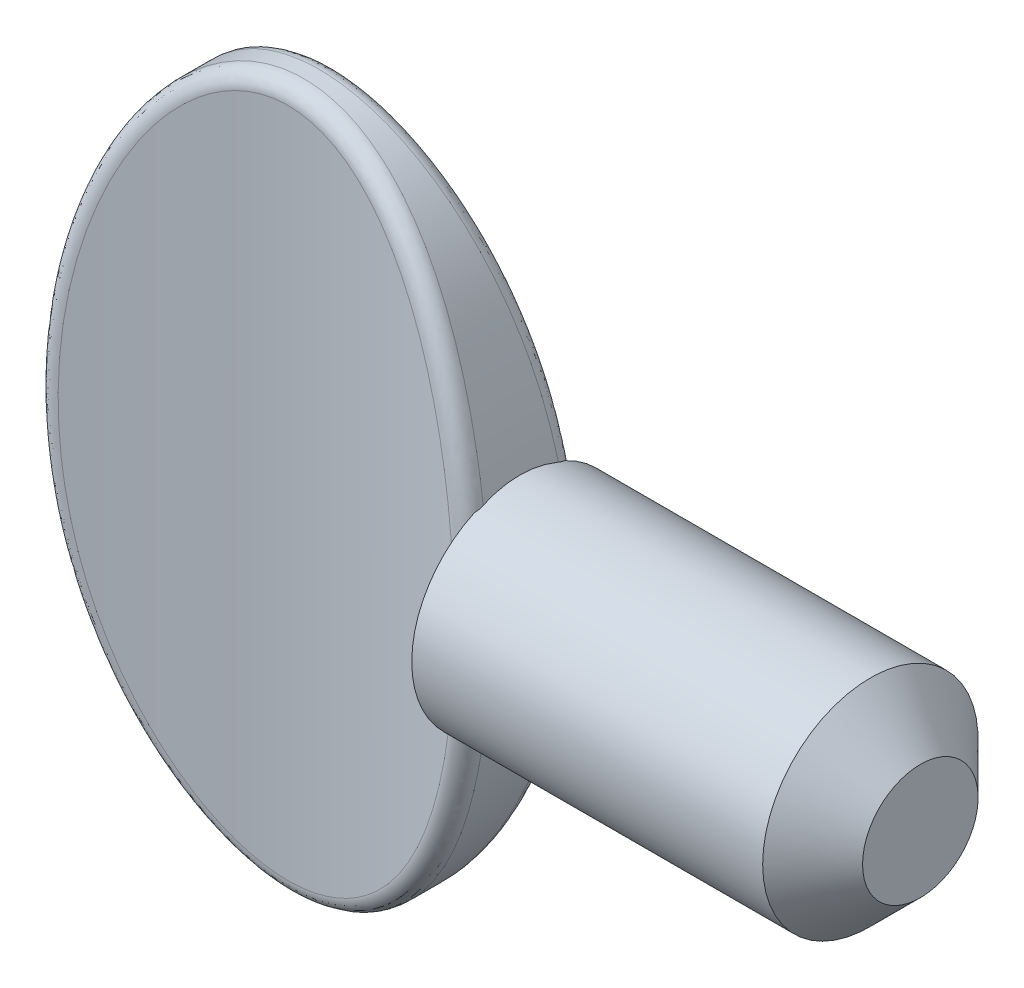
ISO-10303-21;
HEADER;
FILE_DESCRIPTION(('STEP AP214'),'2;1');
FILE_NAME('part.step','',(''),(''),'','','');
FILE_SCHEMA(('AUTOMOTIVE_DESIGN { 1 0 10303 214 1 1 1 1 }'));
ENDSEC;
DATA;
#1=APPLICATION_CONTEXT('core data for automotive mechanical design processes');
#2=APPLICATION_PROTOCOL_DEFINITION('international standard','automotive_design',2000,#1);
#3=PRODUCT_CONTEXT('',#1,'mechanical');
#4=PRODUCT('Part','Part','',(#3));
#5=PRODUCT_RELATED_PRODUCT_CATEGORY('part','',(#4));
#6=PRODUCT_DEFINITION_FORMATION('','',#4);
#7=PRODUCT_DEFINITION_CONTEXT('part definition',#1,'design');
#8=PRODUCT_DEFINITION('design','',#6,#7);
#9=PRODUCT_DEFINITION_SHAPE('','',#8);
#10=(LENGTH_UNIT() NAMED_UNIT(*) SI_UNIT(.MILLI.,.METRE.));
#11=(NAMED_UNIT(*) PLANE_ANGLE_UNIT() SI_UNIT($,.RADIAN.));
#12=(NAMED_UNIT(*) SI_UNIT($,.STERADIAN.) SOLID_ANGLE_UNIT());
#13=UNCERTAINTY_MEASURE_WITH_UNIT(LENGTH_MEASURE(1.E-05),#10,'distance_accuracy_value','');
#14=(GEOMETRIC_REPRESENTATION_CONTEXT(3) GLOBAL_UNCERTAINTY_ASSIGNED_CONTEXT((#13)) GLOBAL_UNIT_ASSIGNED_CONTEXT((#10,
#11,#12)) REPRESENTATION_CONTEXT('',''));
#15=CARTESIAN_POINT('',(0.,0.,0.));
#16=DIRECTION('',(0.,0.,1.));
#17=DIRECTION('',(1.,0.,0.));
#18=AXIS2_PLACEMENT_3D('',#15,#16,#17);
#19=CARTESIAN_POINT('',(0.,0.,1.016));
#20=DIRECTION('',(0.,0.,1.));
#21=DIRECTION('',(0.,-1.,0.));
#22=AXIS2_PLACEMENT_3D('',#19,#20,#21);
#23=ELLIPSE('',#22,5.715,3.556);
#24=DIRECTION('',(0.,0.,-1.));
#25=VECTOR('',#24,1.);
#26=SURFACE_OF_LINEAR_EXTRUSION('',#23,#25);
#27=CARTESIAN_POINT('',(3.41011531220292,-1.62014791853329,0.668376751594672));
#28=CARTESIAN_POINT('',(3.40671804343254,-1.63860905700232,0.623625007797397));
#29=CARTESIAN_POINT('',(3.40360222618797,-1.65521497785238,0.578110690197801));
#30=CARTESIAN_POINT('',(3.39801345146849,-1.68461510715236,0.485826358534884));
#31=CARTESIAN_POINT('',(3.39554052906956,-1.69740910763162,0.439056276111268));
#32=CARTESIAN_POINT('',(3.38920906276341,-1.72990576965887,0.297329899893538));
#33=CARTESIAN_POINT('',(3.38643361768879,-1.74374513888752,0.200903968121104));
#34=CARTESIAN_POINT('',(3.38412486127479,-1.75528275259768,0.00701645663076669));
#35=CARTESIAN_POINT('',(3.38459484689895,-1.75296458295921,-0.0904460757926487));
#36=CARTESIAN_POINT('',(3.38872446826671,-1.73223483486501,-0.283468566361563));
#37=CARTESIAN_POINT('',(3.39237835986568,-1.71385223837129,-0.379031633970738));
#38=CARTESIAN_POINT('',(3.39927526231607,-1.67798412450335,-0.507252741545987));
#39=CARTESIAN_POINT('',(3.40135032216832,-1.66710508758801,-0.541931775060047));
#40=CARTESIAN_POINT('',(3.40584397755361,-1.64323850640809,-0.610479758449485));
#41=CARTESIAN_POINT('',(3.4082620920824,-1.6302539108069,-0.64434976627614));
#42=CARTESIAN_POINT('',(3.41083461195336,-1.61623226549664,-0.677790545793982));
#43=B_SPLINE_CURVE_WITH_KNOTS('',3,(#27,#28,#29,#30,#31,#32,#33,#34,#35,#36,#37,#38,#39,#40,#41,
#42),.UNSPECIFIED.,.F.,.F.,(4,2,2,2,2,2,2,4),(0.,0.145499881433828,0.29100769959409,
0.581851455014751,0.872990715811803,1.16360581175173,1.2727648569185,1.381772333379),.UNSPECIFIED.);
#44=CARTESIAN_POINT('',(3.40596285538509,-1.64255427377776,0.611246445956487));
#45=VERTEX_POINT('',#44);
#46=CARTESIAN_POINT('',(3.40596285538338,-1.6425542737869,-0.611246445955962));
#47=VERTEX_POINT('',#46);
#48=EDGE_CURVE('E70',#45,#47,#43,.T.);
#49=ORIENTED_EDGE('',*,*,#48,.F.);
#50=CARTESIAN_POINT('',(2.87687361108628,2.44813994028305,0.791992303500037));
#51=CARTESIAN_POINT('',(3.18255529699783,2.5496565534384,0.881151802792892));
#52=CARTESIAN_POINT('',(3.19087427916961,2.52247577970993,0.548152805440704));
#53=CARTESIAN_POINT('',(2.94045219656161,2.23528015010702,0.810534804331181));
#54=CARTESIAN_POINT('',(3.25173180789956,2.32661822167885,0.903476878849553));
#55=CARTESIAN_POINT('',(3.25828081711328,2.30224582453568,0.567153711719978));
#56=CARTESIAN_POINT('',(2.99465455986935,2.01926969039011,0.826995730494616));
#57=CARTESIAN_POINT('',(3.31014106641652,2.10195664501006,0.923109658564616));
#58=CARTESIAN_POINT('',(3.31562682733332,2.07916028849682,0.584021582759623));
#59=CARTESIAN_POINT('',(3.08550522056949,1.5830552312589,0.85513976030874));
#60=CARTESIAN_POINT('',(3.40834569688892,1.6476446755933,0.956769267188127));
#61=CARTESIAN_POINT('',(3.41165763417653,1.62919353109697,0.61286138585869));
#62=CARTESIAN_POINT('',(3.12214641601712,1.36284957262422,0.866820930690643));
#63=CARTESIAN_POINT('',(3.4478175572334,1.41867397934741,0.970692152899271));
#64=CARTESIAN_POINT('',(3.45033488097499,1.40231081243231,0.624831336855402));
#65=CARTESIAN_POINT('',(3.17863710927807,0.919742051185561,0.885019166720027));
#66=CARTESIAN_POINT('',(3.50886358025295,0.957217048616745,0.992448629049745));
#67=CARTESIAN_POINT('',(3.50993638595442,0.946080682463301,0.643479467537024));
#68=CARTESIAN_POINT('',(3.19846897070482,0.696837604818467,0.891530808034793));
#69=CARTESIAN_POINT('',(3.53022382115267,0.725447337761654,1.00020785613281));
#70=CARTESIAN_POINT('',(3.53084199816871,0.716730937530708,0.650152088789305));
#71=CARTESIAN_POINT('',(3.22166889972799,0.250038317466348,0.89916161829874));
#72=CARTESIAN_POINT('',(3.55529121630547,0.260137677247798,1.00932947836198));
#73=CARTESIAN_POINT('',(3.55529615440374,0.257136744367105,0.657971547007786));
#74=CARTESIAN_POINT('',(3.22503654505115,0.0261434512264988,0.900280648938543));
#75=CARTESIAN_POINT('',(3.5589182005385,0.0273359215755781,1.0106627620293));
#76=CARTESIAN_POINT('',(3.55884425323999,0.0268922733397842,0.659118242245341));
#77=CARTESIAN_POINT('',(3.21529651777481,-0.424794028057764,0.897065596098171));
#78=CARTESIAN_POINT('',(3.54839475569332,-0.442282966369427,1.00681981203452));
#79=CARTESIAN_POINT('',(3.54857931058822,-0.436885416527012,0.655823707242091));
#80=CARTESIAN_POINT('',(3.20192627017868,-0.651830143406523,0.892644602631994));
#81=CARTESIAN_POINT('',(3.53399566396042,-0.678337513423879,1.00155250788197));
#82=CARTESIAN_POINT('',(3.53448957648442,-0.67041277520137,0.651293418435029));
#83=CARTESIAN_POINT('',(3.15798579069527,-1.10403389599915,0.878342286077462));
#84=CARTESIAN_POINT('',(3.48651511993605,-1.14926850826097,0.98445489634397));
#85=CARTESIAN_POINT('',(3.48815150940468,-1.13578713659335,0.636637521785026));
#86=CARTESIAN_POINT('',(3.12741141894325,-1.32920107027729,0.86845964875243));
#87=CARTESIAN_POINT('',(3.45358537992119,-1.38338047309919,0.972678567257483));
#88=CARTESIAN_POINT('',(3.45589880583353,-1.36763372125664,0.626510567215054));
#89=CARTESIAN_POINT('',(3.04849516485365,-1.77551295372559,0.843590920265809));
#90=CARTESIAN_POINT('',(3.36829281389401,-1.84818795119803,0.942941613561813));
#91=CARTESIAN_POINT('',(3.37255097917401,-1.82763853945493,0.601027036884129));
#92=CARTESIAN_POINT('',(3.00018846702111,-1.99666472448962,0.828614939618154));
#93=CARTESIAN_POINT('',(3.31625058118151,-2.07815631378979,0.925087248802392));
#94=CARTESIAN_POINT('',(3.32149316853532,-2.05580314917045,0.585680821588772));
#95=CARTESIAN_POINT('',(2.88476113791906,-2.43326023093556,0.79411239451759));
#96=CARTESIAN_POINT('',(3.19142384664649,-2.53294503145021,0.883801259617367));
#97=CARTESIAN_POINT('',(3.19926934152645,-2.50695447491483,0.550325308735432));
#98=CARTESIAN_POINT('',(2.81765268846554,-2.64870756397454,0.774588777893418));
#99=CARTESIAN_POINT('',(3.11906951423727,-2.75709243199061,0.860497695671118));
#100=CARTESIAN_POINT('',(3.12811634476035,-2.72994444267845,0.530319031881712));
#101=CARTESIAN_POINT('',(2.65311433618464,-3.0985151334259,0.729048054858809));
#102=CARTESIAN_POINT('',(2.94108253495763,-3.22556424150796,0.805967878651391));
#103=CARTESIAN_POINT('',(2.95319352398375,-3.19660978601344,0.483652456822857));
#104=CARTESIAN_POINT('',(2.55290441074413,-3.33177078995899,0.702519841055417));
#105=CARTESIAN_POINT('',(2.83297127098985,-3.46846636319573,0.774250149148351));
#106=CARTESIAN_POINT('',(2.84641629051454,-3.43928390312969,0.456468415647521));
#107=CARTESIAN_POINT('',(2.32320903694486,-3.78234312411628,0.64640489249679));
#108=CARTESIAN_POINT('',(2.58357223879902,-3.93908503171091,0.706749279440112));
#109=CARTESIAN_POINT('',(2.60051045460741,-3.91004049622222,0.398966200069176));
#110=CARTESIAN_POINT('',(2.19375678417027,-3.99967750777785,0.616821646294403));
#111=CARTESIAN_POINT('',(2.44340804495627,-4.16619911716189,0.671174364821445));
#112=CARTESIAN_POINT('',(2.4614185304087,-4.138139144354,0.368651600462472));
#113=CARTESIAN_POINT('',(1.94091533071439,-4.3535976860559,0.565411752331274));
#114=CARTESIAN_POINT('',(2.16660546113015,-4.53837771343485,0.608745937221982));
#115=CARTESIAN_POINT('',(2.18768136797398,-4.51205711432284,0.315970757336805));
#116=CARTESIAN_POINT('',(1.82542698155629,-4.49608375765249,0.543660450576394));
#117=CARTESIAN_POINT('',(2.04053515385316,-4.68812354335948,0.582339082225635));
#118=CARTESIAN_POINT('',(2.06208689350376,-4.66339853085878,0.29368172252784));
#119=CARTESIAN_POINT('',(1.57466794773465,-4.76186582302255,0.501591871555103));
#120=CARTESIAN_POINT('',(1.76506012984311,-4.96825132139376,0.530990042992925));
#121=CARTESIAN_POINT('',(1.78731476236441,-4.94761823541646,0.250573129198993));
#122=CARTESIAN_POINT('',(1.43943196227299,-4.88519470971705,0.481272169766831));
#123=CARTESIAN_POINT('',(1.61619495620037,-5.09885836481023,0.506044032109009));
#124=CARTESIAN_POINT('',(1.63817843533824,-5.08052812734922,0.229751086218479));
#125=CARTESIAN_POINT('',(1.1911972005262,-5.07171066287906,0.449763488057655));
#126=CARTESIAN_POINT('',(1.340429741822,-5.29730303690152,0.467084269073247));
#127=CARTESIAN_POINT('',(1.36169787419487,-5.28324603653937,0.197463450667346));
#128=CARTESIAN_POINT('',(1.08336860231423,-5.14191532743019,0.437647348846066));
#129=CARTESIAN_POINT('',(1.22051144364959,-5.3722217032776,0.452038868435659));
#130=CARTESIAN_POINT('',(1.24085897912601,-5.36011289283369,0.185047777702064));
#131=CARTESIAN_POINT('',(0.858050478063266,-5.26424468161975,0.416270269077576));
#132=CARTESIAN_POINT('',(0.968834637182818,-5.50292549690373,0.42542157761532));
#133=CARTESIAN_POINT('',(0.986440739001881,-5.49490642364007,0.163142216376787));
#134=CARTESIAN_POINT('',(0.740575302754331,-5.31639564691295,0.407005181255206));
#135=CARTESIAN_POINT('',(0.836995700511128,-5.5590377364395,0.413787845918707));
#136=CARTESIAN_POINT('',(0.85288027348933,-5.55286061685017,0.153648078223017));
#137=CARTESIAN_POINT('',(0.515993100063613,-5.39221579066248,0.393443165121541));
#138=CARTESIAN_POINT('',(0.584104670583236,-5.64060692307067,0.396743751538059));
#139=CARTESIAN_POINT('',(0.595858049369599,-5.63753360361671,0.139750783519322));
#140=CARTESIAN_POINT('',(0.409913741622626,-5.41895204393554,0.38861490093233));
#141=CARTESIAN_POINT('',(0.464186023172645,-5.66954672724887,0.390631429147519));
#142=CARTESIAN_POINT('',(0.473813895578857,-5.66759942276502,0.134803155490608));
#143=CARTESIAN_POINT('',(0.194791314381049,-5.45394261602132,0.382284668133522));
#144=CARTESIAN_POINT('',(0.220889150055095,-5.70732589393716,0.382635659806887));
#145=CARTESIAN_POINT('',(0.225513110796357,-5.70700859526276,0.128316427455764));
#146=CARTESIAN_POINT('',(0.0857502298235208,-5.46220901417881,0.380780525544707));
#147=CARTESIAN_POINT('',(0.0971189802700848,-5.71630681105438,0.380722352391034));
#148=CARTESIAN_POINT('',(0.0992592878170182,-5.71636549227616,0.126775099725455));
#149=CARTESIAN_POINT('',(-0.132181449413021,-5.45950203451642,0.381271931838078));
#150=CARTESIAN_POINT('',(-0.149751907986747,-5.71338033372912,0.381344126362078));
#151=CARTESIAN_POINT('',(-0.15300824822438,-5.71330808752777,0.127278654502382));
#152=CARTESIAN_POINT('',(-0.24107184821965,-5.44851292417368,0.383270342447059));
#153=CARTESIAN_POINT('',(-0.27330895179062,-5.70144504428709,0.383885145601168));
#154=CARTESIAN_POINT('',(-0.27902168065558,-5.70087598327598,0.129326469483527));
#155=CARTESIAN_POINT('',(-0.455477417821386,-5.40829096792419,0.390538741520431));
#156=CARTESIAN_POINT('',(-0.515669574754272,-5.65803605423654,0.393060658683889));
#157=CARTESIAN_POINT('',(-0.526267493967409,-5.65561592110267,0.136774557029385));
#158=CARTESIAN_POINT('',(-0.560990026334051,-5.37904460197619,0.395811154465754));
#159=CARTESIAN_POINT('',(-0.634846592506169,-5.62640367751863,0.399728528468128));
#160=CARTESIAN_POINT('',(-0.647496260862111,-5.62277284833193,0.142177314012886));
#161=CARTESIAN_POINT('',(-0.791362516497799,-5.29549090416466,0.410722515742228));
#162=CARTESIAN_POINT('',(-0.894095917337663,-5.53655861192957,0.418454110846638));
#163=CARTESIAN_POINT('',(-0.910741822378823,-5.52960626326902,0.157457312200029));
#164=CARTESIAN_POINT('',(-0.914651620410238,-5.23680665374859,0.421113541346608));
#165=CARTESIAN_POINT('',(-1.03227791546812,-5.4734725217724,0.431484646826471));
#166=CARTESIAN_POINT('',(-1.05060182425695,-5.46452941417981,0.168105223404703));
#167=CARTESIAN_POINT('',(-1.1501410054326,-5.1000145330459,0.444888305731));
#168=CARTESIAN_POINT('',(-1.29493907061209,-5.32749236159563,0.461037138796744));
#169=CARTESIAN_POINT('',(-1.31582055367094,-5.31418719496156,0.192467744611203));
#170=CARTESIAN_POINT('',(-1.26232097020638,-5.02187196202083,0.458277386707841));
#171=CARTESIAN_POINT('',(-1.41945940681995,-5.24422211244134,0.477628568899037));
#172=CARTESIAN_POINT('',(-1.44115278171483,-5.22888577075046,0.20618782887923));
#173=CARTESIAN_POINT('',(-1.52425358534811,-4.81141848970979,0.493480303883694));
#174=CARTESIAN_POINT('',(-1.71006807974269,-5.02053132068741,0.521084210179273));
#175=CARTESIAN_POINT('',(-1.73197783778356,-5.00086686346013,0.242261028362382));
#176=CARTESIAN_POINT('',(-1.66743267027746,-4.67075761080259,0.516329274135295));
#177=CARTESIAN_POINT('',(-1.86727379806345,-4.87182691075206,0.549058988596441));
#178=CARTESIAN_POINT('',(-1.88928718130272,-4.84982635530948,0.265674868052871));
#179=CARTESIAN_POINT('',(-1.93076565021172,-4.36861808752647,0.56315778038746));
#180=CARTESIAN_POINT('',(-2.15601250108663,-4.55386893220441,0.606083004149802));
#181=CARTESIAN_POINT('',(-2.17678970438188,-4.52789876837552,0.313661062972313));
#182=CARTESIAN_POINT('',(-2.05086652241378,-4.20709289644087,0.587139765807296));
#183=CARTESIAN_POINT('',(-2.28680032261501,-4.38442619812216,0.63511216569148));
#184=CARTESIAN_POINT('',(-2.30692049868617,-4.35696740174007,0.338235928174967));
#185=CARTESIAN_POINT('',(-2.24774440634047,-3.90468381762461,0.629494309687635));
#186=CARTESIAN_POINT('',(-2.50094051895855,-4.06830128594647,0.686196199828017));
#187=CARTESIAN_POINT('',(-2.51931723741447,-4.03858337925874,0.38163755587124));
#188=CARTESIAN_POINT('',(-2.32835126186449,-3.7663893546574,0.648005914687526));
#189=CARTESIAN_POINT('',(-2.58844569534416,-3.92375543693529,0.708482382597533));
#190=CARTESIAN_POINT('',(-2.60592272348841,-3.89353451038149,0.400606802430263));
#191=CARTESIAN_POINT('',(-2.47764655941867,-3.48301662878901,0.68392178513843));
#192=CARTESIAN_POINT('',(-2.750598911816,-3.62773016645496,0.751698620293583));
#193=CARTESIAN_POINT('',(-2.76590357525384,-3.59720408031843,0.437410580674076));
#194=CARTESIAN_POINT('',(-2.54632812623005,-3.33793451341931,0.701325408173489));
#195=CARTESIAN_POINT('',(-2.82495665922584,-3.4763903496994,0.772577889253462));
#196=CARTESIAN_POINT('',(-2.83927131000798,-3.44591898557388,0.455244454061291));
#197=CARTESIAN_POINT('',(-2.73596214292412,-2.89487609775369,0.751105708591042));
#198=CARTESIAN_POINT('',(-3.03164049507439,-3.01174573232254,0.832642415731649));
#199=CARTESIAN_POINT('',(-3.04146428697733,-2.98492820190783,0.506255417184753));
#200=CARTESIAN_POINT('',(-2.84046694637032,-2.58914736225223,0.781043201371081));
#201=CARTESIAN_POINT('',(-3.1439027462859,-2.69404108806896,0.868280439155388));
#202=CARTESIAN_POINT('',(-3.15233965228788,-2.66814963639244,0.53693302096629));
#203=CARTESIAN_POINT('',(-3.02361670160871,-1.91917408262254,0.835455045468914));
#204=CARTESIAN_POINT('',(-3.34221273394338,-1.99525212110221,0.933484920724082));
#205=CARTESIAN_POINT('',(-3.34632626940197,-1.97562309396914,0.592690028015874));
#206=CARTESIAN_POINT('',(-3.09598835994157,-1.55305613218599,0.858425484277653));
#207=CARTESIAN_POINT('',(-3.41971506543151,-1.61558535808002,0.960711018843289));
#208=CARTESIAN_POINT('',(-3.42273238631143,-1.59818444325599,0.616228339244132));
#209=CARTESIAN_POINT('',(-3.19389380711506,-0.813438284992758,0.889906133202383));
#210=CARTESIAN_POINT('',(-3.52551559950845,-0.845326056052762,0.998352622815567));
#211=CARTESIAN_POINT('',(-3.52603668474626,-0.836598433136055,0.648487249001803));
#212=CARTESIAN_POINT('',(-3.219394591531,-0.439933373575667,0.898406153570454));
#213=CARTESIAN_POINT('',(-3.55284253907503,-0.458062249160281,1.00842962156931));
#214=CARTESIAN_POINT('',(-3.55289998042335,-0.452446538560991,0.657197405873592));
#215=CARTESIAN_POINT('',(-3.22377462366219,0.165515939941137,0.899871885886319));
#216=CARTESIAN_POINT('',(-3.55753925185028,0.172415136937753,1.01016840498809));
#217=CARTESIAN_POINT('',(-3.55751322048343,0.170223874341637,0.658699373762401));
#218=CARTESIAN_POINT('',(-3.21666132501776,0.397456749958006,0.897504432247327));
#219=CARTESIAN_POINT('',(-3.54988979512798,0.413553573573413,1.00735185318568));
#220=CARTESIAN_POINT('',(-3.55001934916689,0.408752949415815,0.656273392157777));
#221=CARTESIAN_POINT('',(-3.18467556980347,0.860036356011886,0.887014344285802));
#222=CARTESIAN_POINT('',(-3.51533559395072,0.895293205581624,0.994814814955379));
#223=CARTESIAN_POINT('',(-3.5162998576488,0.884649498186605,0.645523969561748));
#224=CARTESIAN_POINT('',(-3.15979714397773,1.09067468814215,0.878889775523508));
#225=CARTESIAN_POINT('',(-3.48854259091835,1.1350753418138,0.9851346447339));
#226=CARTESIAN_POINT('',(-3.49006794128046,1.12201655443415,0.637198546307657));
#227=CARTESIAN_POINT('',(-3.09177046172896,1.54865418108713,0.857163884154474));
#228=CARTESIAN_POINT('',(-3.41502593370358,1.61202494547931,0.959158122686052));
#229=CARTESIAN_POINT('',(-3.41826670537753,1.59374884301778,0.614935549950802));
#230=CARTESIAN_POINT('',(-3.04863796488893,1.77599801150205,0.843567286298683));
#231=CARTESIAN_POINT('',(-3.36857207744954,1.84840189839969,0.942954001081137));
#232=CARTESIAN_POINT('',(-3.37271406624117,1.82811648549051,0.601002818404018));
#233=CARTESIAN_POINT('',(-2.94317111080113,2.22543485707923,0.811418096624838));
#234=CARTESIAN_POINT('',(-3.25454291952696,2.31651004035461,0.904496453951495));
#235=CARTESIAN_POINT('',(-3.26114490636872,2.29208476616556,0.568058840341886));
#236=CARTESIAN_POINT('',(-2.88084877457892,2.44753106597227,0.792868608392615));
#237=CARTESIAN_POINT('',(-3.18737593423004,2.54750357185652,0.882369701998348));
#238=CARTESIAN_POINT('',(-3.1951411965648,2.52168829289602,0.549050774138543));
#239=CARTESIAN_POINT('',(-2.72296807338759,2.92171701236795,0.747996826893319));
#240=CARTESIAN_POINT('',(-3.01671846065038,3.04112688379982,0.828682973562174));
#241=CARTESIAN_POINT('',(-3.02753524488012,3.01295829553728,0.503069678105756));
#242=CARTESIAN_POINT('',(-2.62354531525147,3.17242818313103,0.720887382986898));
#243=CARTESIAN_POINT('',(-2.9095837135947,3.3020505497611,0.796309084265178));
#244=CARTESIAN_POINT('',(-2.92177195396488,3.27338041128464,0.475290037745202));
#245=CARTESIAN_POINT('',(-2.45047373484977,3.53592668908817,0.677330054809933));
#246=CARTESIAN_POINT('',(-2.72089131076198,3.68328686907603,0.743720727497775));
#247=CARTESIAN_POINT('',(-2.73679732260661,3.65249750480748,0.430655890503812));
#248=CARTESIAN_POINT('',(-2.38881716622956,3.6549621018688,0.662334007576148));
#249=CARTESIAN_POINT('',(-2.65403373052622,3.80757139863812,0.725698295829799));
#250=CARTESIAN_POINT('',(-2.6707761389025,3.77691258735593,0.415289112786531));
#251=CARTESIAN_POINT('',(-2.25689122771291,3.88780573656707,0.631713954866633));
#252=CARTESIAN_POINT('',(-2.51060863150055,4.0509787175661,0.688809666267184));
#253=CARTESIAN_POINT('',(-2.52910566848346,4.02092289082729,0.383912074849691));
#254=CARTESIAN_POINT('',(-2.18662455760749,4.00161558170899,0.616090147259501));
#255=CARTESIAN_POINT('',(-2.43421779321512,4.17003284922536,0.669971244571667));
#256=CARTESIAN_POINT('',(-2.45345939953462,4.14051960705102,0.367902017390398));
#257=CARTESIAN_POINT('',(-2.00630311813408,4.26762511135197,0.578214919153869));
#258=CARTESIAN_POINT('',(-2.23805461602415,4.4481030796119,0.624273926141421));
#259=CARTESIAN_POINT('',(-2.25863520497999,4.42099703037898,0.329090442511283));
#260=CARTESIAN_POINT('',(-1.89168515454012,4.4166251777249,0.555850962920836));
#261=CARTESIAN_POINT('',(-2.11309442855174,4.60451461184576,0.597170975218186));
#262=CARTESIAN_POINT('',(-2.1342612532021,4.57889839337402,0.306173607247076));
#263=CARTESIAN_POINT('',(-1.64204982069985,4.69578543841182,0.512276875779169));
#264=CARTESIAN_POINT('',(-1.83921681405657,4.89842163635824,0.544072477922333));
#265=CARTESIAN_POINT('',(-1.86139526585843,4.87668575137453,0.261522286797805));
#266=CARTESIAN_POINT('',(-1.50706569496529,4.82597567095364,0.491064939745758));
#267=CARTESIAN_POINT('',(-1.69088789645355,5.03609559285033,0.518086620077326));
#268=CARTESIAN_POINT('',(-1.71294250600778,5.01660042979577,0.239785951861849));
#269=CARTESIAN_POINT('',(-1.25822257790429,5.02460380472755,0.457805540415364));
#270=CARTESIAN_POINT('',(-1.41485811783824,5.24717231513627,0.477035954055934));
#271=CARTESIAN_POINT('',(-1.43656618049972,5.23187493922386,0.205704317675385));
#272=CARTESIAN_POINT('',(-1.14977220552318,5.09995591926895,0.444894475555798));
#273=CARTESIAN_POINT('',(-1.29446557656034,5.32746078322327,0.461038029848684));
#274=CARTESIAN_POINT('',(-1.3153835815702,5.31413478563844,0.192474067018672));
#275=CARTESIAN_POINT('',(-0.922470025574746,5.23252776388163,0.421861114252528));
#276=CARTESIAN_POINT('',(-1.04096461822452,5.4689251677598,0.432410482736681));
#277=CARTESIAN_POINT('',(-1.0594278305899,5.45981518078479,0.16887127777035));
#278=CARTESIAN_POINT('',(-0.80363402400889,5.28977445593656,0.41173467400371));
#279=CARTESIAN_POINT('',(-0.907817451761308,5.53043531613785,0.419719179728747));
#280=CARTESIAN_POINT('',(-0.924675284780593,5.5232637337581,0.158494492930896));
#281=CARTESIAN_POINT('',(-0.577455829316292,5.37398354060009,0.39672020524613));
#282=CARTESIAN_POINT('',(-0.653408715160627,5.62094693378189,0.40087394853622));
#283=CARTESIAN_POINT('',(-0.666376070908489,5.6171058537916,0.143108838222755));
#284=CARTESIAN_POINT('',(-0.471370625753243,5.4043497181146,0.391249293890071));
#285=CARTESIAN_POINT('',(-0.5336224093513,5.65378212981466,0.393957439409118));
#286=CARTESIAN_POINT('',(-0.544550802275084,5.65118930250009,0.13750267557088));
#287=CARTESIAN_POINT('',(-0.255633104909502,5.44661210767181,0.38361532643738));
#288=CARTESIAN_POINT('',(-0.289803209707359,5.69938537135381,0.384322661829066));
#289=CARTESIAN_POINT('',(-0.295851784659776,5.69872932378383,0.129679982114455));
#290=CARTESIAN_POINT('',(-0.145983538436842,5.45852223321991,0.38144977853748));
#291=CARTESIAN_POINT('',(-0.165395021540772,5.71232072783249,0.381569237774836));
#292=CARTESIAN_POINT('',(-0.168981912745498,5.71220143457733,0.127460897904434));
#293=CARTESIAN_POINT('',(0.0738869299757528,5.46278107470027,0.380676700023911));
#294=CARTESIAN_POINT('',(0.0836678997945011,5.7169249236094,0.380591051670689));
#295=CARTESIAN_POINT('',(0.0855232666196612,5.71701154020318,0.126668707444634));
#296=CARTESIAN_POINT('',(0.184108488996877,5.45509623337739,0.382075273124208));
#297=CARTESIAN_POINT('',(0.208792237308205,5.70857455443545,0.382370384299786));
#298=CARTESIAN_POINT('',(0.21315951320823,5.70831156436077,0.128101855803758));
#299=CARTESIAN_POINT('',(0.401619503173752,5.42083768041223,0.38827437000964));
#300=CARTESIAN_POINT('',(0.454815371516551,5.67158273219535,0.390201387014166));
#301=CARTESIAN_POINT('',(0.464261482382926,5.66972014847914,0.134454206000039));
#302=CARTESIAN_POINT('',(0.50890688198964,5.3942509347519,0.393077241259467));
#303=CARTESIAN_POINT('',(0.576122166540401,5.64279808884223,0.39628327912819));
#304=CARTESIAN_POINT('',(0.587724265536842,5.63981408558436,0.13937581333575));
#305=CARTESIAN_POINT('',(0.739415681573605,5.31719606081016,0.40686416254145));
#306=CARTESIAN_POINT('',(0.83573942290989,5.55988553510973,0.41361366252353));
#307=CARTESIAN_POINT('',(0.851580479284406,5.55374603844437,0.153503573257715));
#308=CARTESIAN_POINT('',(0.861383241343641,5.26294420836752,0.416504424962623));
#309=CARTESIAN_POINT('',(0.972626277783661,5.50149772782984,0.425721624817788));
#310=CARTESIAN_POINT('',(0.990242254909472,5.49345262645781,0.163382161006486));
#311=CARTESIAN_POINT('',(1.0949077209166,5.13510542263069,0.438830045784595));
#312=CARTESIAN_POINT('',(1.23342883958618,5.36492676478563,0.453514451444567));
#313=CARTESIAN_POINT('',(1.2538468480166,5.35263149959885,0.186259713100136));
#314=CARTESIAN_POINT('',(1.20644657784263,5.06148575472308,0.451520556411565));
#315=CARTESIAN_POINT('',(1.35742533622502,5.28637625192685,0.469268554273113));
#316=CARTESIAN_POINT('',(1.37876592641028,5.2720695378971,0.199263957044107));
#317=CARTESIAN_POINT('',(1.46573802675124,4.86335533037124,0.484912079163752));
#318=CARTESIAN_POINT('',(1.64542638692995,5.0755944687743,0.510545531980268));
#319=CARTESIAN_POINT('',(1.66733639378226,5.05689690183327,0.233480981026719));
#320=CARTESIAN_POINT('',(1.60745261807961,4.73079185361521,0.506661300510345));
#321=CARTESIAN_POINT('',(1.80127145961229,4.93527393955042,0.537224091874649));
#322=CARTESIAN_POINT('',(1.82341116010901,4.914206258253,0.255767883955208));
#323=CARTESIAN_POINT('',(1.86900175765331,4.44495554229,0.551550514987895));
#324=CARTESIAN_POINT('',(2.08839377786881,4.63419132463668,0.591965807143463));
#325=CARTESIAN_POINT('',(2.10960205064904,4.60897313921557,0.301766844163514));
#326=CARTESIAN_POINT('',(1.98878809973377,4.29163833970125,0.574693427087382));
#327=CARTESIAN_POINT('',(2.21900804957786,4.47319746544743,0.620024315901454));
#328=CARTESIAN_POINT('',(2.23966103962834,4.44638820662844,0.32548189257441));
#329=CARTESIAN_POINT('',(2.18584389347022,4.00402857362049,0.615817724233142));
#330=CARTESIAN_POINT('',(2.43354527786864,4.17232015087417,0.669684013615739));
#331=CARTESIAN_POINT('',(2.45265033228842,4.14301394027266,0.367622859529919));
#332=CARTESIAN_POINT('',(2.26678612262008,3.87233883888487,0.633878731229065));
#333=CARTESIAN_POINT('',(2.52149542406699,4.03457978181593,0.691453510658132));
#334=CARTESIAN_POINT('',(2.5397676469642,4.00465027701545,0.386130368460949));
#335=CARTESIAN_POINT('',(2.4172945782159,3.60212171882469,0.669113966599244));
#336=CARTESIAN_POINT('',(2.68508948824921,3.75215155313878,0.733890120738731));
#337=CARTESIAN_POINT('',(2.70131013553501,3.72162071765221,0.422236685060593));
#338=CARTESIAN_POINT('',(2.48685442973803,3.463590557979,0.686287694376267));
#339=CARTESIAN_POINT('',(2.76046142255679,3.60757416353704,0.754513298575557));
#340=CARTESIAN_POINT('',(2.77572819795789,3.57695134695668,0.439834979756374));
#341=CARTESIAN_POINT('',(2.61551558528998,3.18118784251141,0.71926816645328));
#342=CARTESIAN_POINT('',(2.89998706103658,3.31289252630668,0.794118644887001));
#343=CARTESIAN_POINT('',(2.91309166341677,3.28272006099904,0.473630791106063));
#344=CARTESIAN_POINT('',(2.6746042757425,3.03731009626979,0.73507325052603));
#345=CARTESIAN_POINT('',(2.96389868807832,3.16294480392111,0.813050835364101));
#346=CARTESIAN_POINT('',(2.97602323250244,3.13315249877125,0.489826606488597));
#347=CARTESIAN_POINT('',(2.78296275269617,2.74552013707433,0.764925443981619));
#348=CARTESIAN_POINT('',(3.08122852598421,2.85877616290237,0.84882953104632));
#349=CARTESIAN_POINT('',(3.09125015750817,2.83035190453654,0.520416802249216));
#350=CARTESIAN_POINT('',(2.83222971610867,2.59760677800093,0.778972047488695));
#351=CARTESIAN_POINT('',(3.13445317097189,2.70474702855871,0.865627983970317));
#352=CARTESIAN_POINT('',(3.14354245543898,2.67711783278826,0.534810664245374));
#353=CARTESIAN_POINT('',(2.87687361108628,2.44813994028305,0.791992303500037));
#354=CARTESIAN_POINT('',(3.18255529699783,2.5496565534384,0.881151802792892));
#355=CARTESIAN_POINT('',(3.19087427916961,2.52247577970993,0.548152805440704));
#356=(BOUNDED_SURFACE() B_SPLINE_SURFACE(3,2,((#50,#51,#52),(#53,#54,#55),(#56,#57,#58),(#59,
#60,#61),(#62,#63,#64),(#65,#66,#67),(#68,#69,#70),(#71,#72,#73),(#74,#75,#76),(#77,#78,#79),
(#80,#81,#82),(#83,#84,#85),(#86,#87,#88),(#89,#90,#91),(#92,#93,#94),(#95,#96,#97),(#98,#99,
#100),(#101,#102,#103),(#104,#105,#106),(#107,#108,#109),(#110,#111,#112),(#113,#114,#115),
(#116,#117,#118),(#119,#120,#121),(#122,#123,#124),(#125,#126,#127),(#128,#129,#130),(#131,#132,
#133),(#134,#135,#136),(#137,#138,#139),(#140,#141,#142),(#143,#144,#145),(#146,#147,#148),
(#149,#150,#151),(#152,#153,#154),(#155,#156,#157),(#158,#159,#160),(#161,#162,#163),(#164,#165,
#166),(#167,#168,#169),(#170,#171,#172),(#173,#174,#175),(#176,#177,#178),(#179,#180,#181),
(#182,#183,#184),(#185,#186,#187),(#188,#189,#190),(#191,#192,#193),(#194,#195,#196),(#197,#198,
#199),(#200,#201,#202),(#203,#204,#205),(#206,#207,#208),(#209,#210,#211),(#212,#213,#214),
(#215,#216,#217),(#218,#219,#220),(#221,#222,#223),(#224,#225,#226),(#227,#228,#229),(#230,#231,
#232),(#233,#234,#235),(#236,#237,#238),(#239,#240,#241),(#242,#243,#244),(#245,#246,#247),
(#248,#249,#250),(#251,#252,#253),(#254,#255,#256),(#257,#258,#259),(#260,#261,#262),(#263,#264,
#265),(#266,#267,#268),(#269,#270,#271),(#272,#273,#274),(#275,#276,#277),(#278,#279,#280),
(#281,#282,#283),(#284,#285,#286),(#287,#288,#289),(#290,#291,#292),(#293,#294,#295),(#296,#297,
#298),(#299,#300,#301),(#302,#303,#304),(#305,#306,#307),(#308,#309,#310),(#311,#312,#313),
(#314,#315,#316),(#317,#318,#319),(#320,#321,#322),(#323,#324,#325),(#326,#327,#328),(#329,#330,
#331),(#332,#333,#334),(#335,#336,#337),(#338,#339,#340),(#341,#342,#343),(#344,#345,#346),
(#347,#348,#349),(#350,#351,#352),(#353,#354,#355)),.UNSPECIFIED.,.T.,.F.,
.F.) B_SPLINE_SURFACE_WITH_KNOTS((4,2,2,2,2,2,2,2,2,2,2,2,2,2,2,2,2,2,2,2,2,2,2,2,2,2,2,2,2,2,2,
2,2,2,2,2,2,2,2,2,2,2,2,2,2,2,2,2,2,2,4),(3,3),(0.,0.670088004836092,1.34044677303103,
2.01150801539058,2.68258646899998,3.36432560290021,4.04622885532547,4.72678632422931,
5.40690386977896,6.17399274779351,6.94021517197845,7.49835151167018,8.05551867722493,
8.44869733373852,8.84130132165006,9.17597761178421,9.51043495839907,9.8451656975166,
10.1801446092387,10.5969595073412,11.0145231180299,11.6249253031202,12.2367135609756,
12.7226461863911,13.2088580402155,14.1814928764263,15.3007522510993,16.4207994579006,
17.116313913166,17.8120621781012,18.5072109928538,19.2019252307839,20.0156340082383,
20.4222285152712,20.8286958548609,21.4003838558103,21.9711485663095,22.3745805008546,
22.7774087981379,23.1149751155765,23.4522868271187,23.7901765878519,24.1282995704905,
24.5358772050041,24.9441481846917,25.5345239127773,26.1261823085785,26.5957484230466,
27.0655766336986,27.5359670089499,28.0064923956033),(0.,1.),
.UNSPECIFIED.) GEOMETRIC_REPRESENTATION_ITEM() RATIONAL_B_SPLINE_SURFACE(((1.,0.605083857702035,
1.),(1.,0.601611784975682,1.),(1.,0.5986115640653,1.),(1.,0.59355041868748,1.),(1.,
0.591489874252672,1.),(1.,0.588302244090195,1.),(1.,0.587176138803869,1.),(1.,0.585858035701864,
1.),(1.,0.585666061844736,1.),(1.,0.586220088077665,1.),(1.,0.586981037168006,1.),(1.,
0.589468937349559,1.),(1.,0.591196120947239,1.),(1.,0.59561711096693,1.),(1.,0.598309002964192,
1.),(1.,0.60466419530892,1.),(1.,0.6083268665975,1.),(1.,0.617156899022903,1.),(1.,
0.622456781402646,1.),(1.,0.634262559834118,1.),(1.,0.640767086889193,1.),(1.,0.652862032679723,
1.),(1.,0.658220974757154,1.),(1.,0.669205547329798,1.),(1.,0.674830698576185,1.),(1.,
0.684105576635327,1.),(1.,0.687849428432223,1.),(1.,0.69472599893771,1.),(1.,0.697859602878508,
1.),(1.,0.702576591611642,1.),(1.,0.704320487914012,1.),(1.,0.70662574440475,1.),(1.,
0.707187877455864,1.),(1.,0.707006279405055,1.),(1.,0.706261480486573,1.),(1.,0.70362723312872,
1.),(1.,0.701736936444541,1.),(1.,0.696594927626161,1.),(1.,0.693123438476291,1.),(1.,
0.685596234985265,1.),(1.,0.681539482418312,1.),(1.,0.671400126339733,1.),(1.,0.665247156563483,
1.),(1.,0.653377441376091,1.),(1.,0.647661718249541,1.),(1.,0.638021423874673,1.),(1.,
0.633970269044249,1.),(1.,0.626341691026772,1.),(1.,0.622764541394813,1.),(1.,0.612770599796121,
1.),(1.,0.607093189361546,1.),(1.,0.597028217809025,1.),(1.,0.592964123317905,1.),(1.,
0.587442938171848,1.),(1.,0.585987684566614,1.),(1.,0.585737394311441,1.),(1.,0.586143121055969,
1.),(1.,0.587958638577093,1.),(1.,0.589368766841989,1.),(1.,0.593196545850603,1.),(1.,
0.595613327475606,1.),(1.,0.601457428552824,1.),(1.,0.604884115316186,1.),(1.,0.613433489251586,
1.),(1.,0.618746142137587,1.),(1.,0.627733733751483,1.),(1.,0.630898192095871,1.),(1.,
0.6375502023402,1.),(1.,0.641037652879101,1.),(1.,0.649782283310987,1.),(1.,0.655182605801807,
1.),(1.,0.666333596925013,1.),(1.,0.672083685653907,1.),(1.,0.681684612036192,1.),(1.,
0.685598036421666,1.),(1.,0.692883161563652,1.),(1.,0.69625566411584,1.),(1.,0.701416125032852,
1.),(1.,0.703372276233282,1.),(1.,0.706134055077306,1.),(1.,0.706940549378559,1.),(1.,
0.707226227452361,1.),(1.,0.70670313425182,1.),(1.,0.704443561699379,1.),(1.,0.702706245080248,
1.),(1.,0.69790604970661,1.),(1.,0.694644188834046,1.),(1.,0.687475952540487,1.),(1.,
0.683568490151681,1.),(1.,0.673792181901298,1.),(1.,0.667825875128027,1.),(1.,0.65623775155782,
1.),(1.,0.650616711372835,1.),(1.,0.64108568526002,1.),(1.,0.637061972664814,1.),(1.,
0.629448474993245,1.),(1.,0.625858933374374,1.),(1.,0.619133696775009,1.),(1.,0.615998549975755,
1.),(1.,0.610192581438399,1.),(1.,0.607521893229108,1.),(1.,0.605083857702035,1.))) REPRESENTATION_ITEM('') SURFACE());
#357=CARTESIAN_POINT('',(3.19087427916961,2.52247577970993,0.548152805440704));
#358=CARTESIAN_POINT('',(3.25828081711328,2.30224582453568,0.567153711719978));
#359=CARTESIAN_POINT('',(3.31562682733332,2.07916028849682,0.584021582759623));
#360=CARTESIAN_POINT('',(3.41165763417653,1.62919353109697,0.61286138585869));
#361=CARTESIAN_POINT('',(3.45033488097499,1.40231081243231,0.624831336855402));
#362=CARTESIAN_POINT('',(3.50993638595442,0.946080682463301,0.643479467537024));
#363=CARTESIAN_POINT('',(3.5308419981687,0.716730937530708,0.650152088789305));
#364=CARTESIAN_POINT('',(3.55529615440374,0.257136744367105,0.657971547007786));
#365=CARTESIAN_POINT('',(3.55884425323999,0.0268922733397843,0.659118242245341));
#366=CARTESIAN_POINT('',(3.54857931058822,-0.436885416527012,0.655823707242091));
#367=CARTESIAN_POINT('',(3.53448957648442,-0.67041277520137,0.651293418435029));
#368=CARTESIAN_POINT('',(3.48815150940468,-1.13578713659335,0.636637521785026));
#369=CARTESIAN_POINT('',(3.45589880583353,-1.36763372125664,0.626510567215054));
#370=CARTESIAN_POINT('',(3.37255097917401,-1.82763853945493,0.601027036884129));
#371=CARTESIAN_POINT('',(3.32149316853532,-2.05580314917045,0.585680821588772));
#372=CARTESIAN_POINT('',(3.19926934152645,-2.50695447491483,0.550325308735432));
#373=CARTESIAN_POINT('',(3.12811634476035,-2.72994444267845,0.530319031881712));
#374=CARTESIAN_POINT('',(2.95319352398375,-3.19660978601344,0.483652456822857));
#375=CARTESIAN_POINT('',(2.84641629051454,-3.43928390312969,0.456468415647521));
#376=CARTESIAN_POINT('',(2.60051045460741,-3.91004049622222,0.398966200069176));
#377=CARTESIAN_POINT('',(2.4614185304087,-4.138139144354,0.368651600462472));
#378=CARTESIAN_POINT('',(2.18768136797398,-4.51205711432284,0.315970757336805));
#379=CARTESIAN_POINT('',(2.06208689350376,-4.66339853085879,0.29368172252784));
#380=CARTESIAN_POINT('',(1.78731476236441,-4.94761823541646,0.250573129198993));
#381=CARTESIAN_POINT('',(1.63817843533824,-5.08052812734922,0.229751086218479));
#382=CARTESIAN_POINT('',(1.36169787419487,-5.28324603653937,0.197463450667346));
#383=CARTESIAN_POINT('',(1.24085897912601,-5.36011289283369,0.185047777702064));
#384=CARTESIAN_POINT('',(0.986440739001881,-5.49490642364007,0.163142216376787));
#385=CARTESIAN_POINT('',(0.852880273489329,-5.55286061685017,0.153648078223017));
#386=CARTESIAN_POINT('',(0.595858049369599,-5.63753360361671,0.139750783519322));
#387=CARTESIAN_POINT('',(0.473813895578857,-5.66759942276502,0.134803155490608));
#388=CARTESIAN_POINT('',(0.225513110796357,-5.70700859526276,0.128316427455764));
#389=CARTESIAN_POINT('',(0.0992592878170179,-5.71636549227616,0.126775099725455));
#390=CARTESIAN_POINT('',(-0.15300824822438,-5.71330808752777,0.127278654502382));
#391=CARTESIAN_POINT('',(-0.279021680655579,-5.70087598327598,0.129326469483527));
#392=CARTESIAN_POINT('',(-0.526267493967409,-5.65561592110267,0.136774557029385));
#393=CARTESIAN_POINT('',(-0.647496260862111,-5.62277284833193,0.142177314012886));
#394=CARTESIAN_POINT('',(-0.910741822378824,-5.52960626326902,0.157457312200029));
#395=CARTESIAN_POINT('',(-1.05060182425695,-5.46452941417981,0.168105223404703));
#396=CARTESIAN_POINT('',(-1.31582055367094,-5.31418719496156,0.192467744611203));
#397=CARTESIAN_POINT('',(-1.44115278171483,-5.22888577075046,0.20618782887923));
#398=CARTESIAN_POINT('',(-1.73197783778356,-5.00086686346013,0.242261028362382));
#399=CARTESIAN_POINT('',(-1.88928718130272,-4.84982635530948,0.265674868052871));
#400=CARTESIAN_POINT('',(-2.17678970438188,-4.52789876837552,0.313661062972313));
#401=CARTESIAN_POINT('',(-2.30692049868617,-4.35696740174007,0.338235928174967));
#402=CARTESIAN_POINT('',(-2.51931723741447,-4.03858337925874,0.38163755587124));
#403=CARTESIAN_POINT('',(-2.60592272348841,-3.89353451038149,0.400606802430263));
#404=CARTESIAN_POINT('',(-2.76590357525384,-3.59720408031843,0.437410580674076));
#405=CARTESIAN_POINT('',(-2.83927131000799,-3.44591898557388,0.455244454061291));
#406=CARTESIAN_POINT('',(-3.04146428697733,-2.98492820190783,0.506255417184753));
#407=CARTESIAN_POINT('',(-3.15233965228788,-2.66814963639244,0.53693302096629));
#408=CARTESIAN_POINT('',(-3.34632626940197,-1.97562309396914,0.592690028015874));
#409=CARTESIAN_POINT('',(-3.42273238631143,-1.59818444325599,0.616228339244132));
#410=CARTESIAN_POINT('',(-3.52603668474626,-0.836598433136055,0.648487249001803));
#411=CARTESIAN_POINT('',(-3.55289998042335,-0.45244653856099,0.657197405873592));
#412=CARTESIAN_POINT('',(-3.55751322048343,0.170223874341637,0.658699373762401));
#413=CARTESIAN_POINT('',(-3.55001934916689,0.408752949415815,0.656273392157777));
#414=CARTESIAN_POINT('',(-3.5162998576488,0.884649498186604,0.645523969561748));
#415=CARTESIAN_POINT('',(-3.49006794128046,1.12201655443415,0.637198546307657));
#416=CARTESIAN_POINT('',(-3.41826670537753,1.59374884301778,0.614935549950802));
#417=CARTESIAN_POINT('',(-3.37271406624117,1.82811648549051,0.601002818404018));
#418=CARTESIAN_POINT('',(-3.26114490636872,2.29208476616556,0.568058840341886));
#419=CARTESIAN_POINT('',(-3.1951411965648,2.52168829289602,0.549050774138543));
#420=CARTESIAN_POINT('',(-3.02753524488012,3.01295829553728,0.503069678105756));
#421=CARTESIAN_POINT('',(-2.92177195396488,3.27338041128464,0.475290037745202));
#422=CARTESIAN_POINT('',(-2.73679732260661,3.65249750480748,0.430655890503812));
#423=CARTESIAN_POINT('',(-2.6707761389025,3.77691258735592,0.415289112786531));
#424=CARTESIAN_POINT('',(-2.52910566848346,4.02092289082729,0.383912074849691));
#425=CARTESIAN_POINT('',(-2.45345939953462,4.14051960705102,0.367902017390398));
#426=CARTESIAN_POINT('',(-2.25863520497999,4.42099703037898,0.329090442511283));
#427=CARTESIAN_POINT('',(-2.1342612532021,4.57889839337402,0.306173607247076));
#428=CARTESIAN_POINT('',(-1.86139526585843,4.87668575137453,0.261522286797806));
#429=CARTESIAN_POINT('',(-1.71294250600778,5.01660042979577,0.239785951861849));
#430=CARTESIAN_POINT('',(-1.43656618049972,5.23187493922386,0.205704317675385));
#431=CARTESIAN_POINT('',(-1.3153835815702,5.31413478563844,0.192474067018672));
#432=CARTESIAN_POINT('',(-1.0594278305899,5.45981518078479,0.16887127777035));
#433=CARTESIAN_POINT('',(-0.924675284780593,5.5232637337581,0.158494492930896));
#434=CARTESIAN_POINT('',(-0.66637607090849,5.6171058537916,0.143108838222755));
#435=CARTESIAN_POINT('',(-0.544550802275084,5.65118930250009,0.13750267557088));
#436=CARTESIAN_POINT('',(-0.295851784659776,5.69872932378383,0.129679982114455));
#437=CARTESIAN_POINT('',(-0.168981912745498,5.71220143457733,0.127460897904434));
#438=CARTESIAN_POINT('',(0.085523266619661,5.71701154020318,0.126668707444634));
#439=CARTESIAN_POINT('',(0.21315951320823,5.70831156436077,0.128101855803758));
#440=CARTESIAN_POINT('',(0.464261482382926,5.66972014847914,0.134454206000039));
#441=CARTESIAN_POINT('',(0.587724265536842,5.63981408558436,0.13937581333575));
#442=CARTESIAN_POINT('',(0.851580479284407,5.55374603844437,0.153503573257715));
#443=CARTESIAN_POINT('',(0.990242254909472,5.49345262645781,0.163382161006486));
#444=CARTESIAN_POINT('',(1.2538468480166,5.35263149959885,0.186259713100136));
#445=CARTESIAN_POINT('',(1.37876592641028,5.2720695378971,0.199263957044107));
#446=CARTESIAN_POINT('',(1.66733639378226,5.05689690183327,0.233480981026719));
#447=CARTESIAN_POINT('',(1.82341116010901,4.914206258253,0.255767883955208));
#448=CARTESIAN_POINT('',(2.10960205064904,4.60897313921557,0.301766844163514));
#449=CARTESIAN_POINT('',(2.23966103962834,4.44638820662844,0.32548189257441));
#450=CARTESIAN_POINT('',(2.45265033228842,4.14301394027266,0.367622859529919));
#451=CARTESIAN_POINT('',(2.5397676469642,4.00465027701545,0.386130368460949));
#452=CARTESIAN_POINT('',(2.70131013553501,3.72162071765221,0.422236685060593));
#453=CARTESIAN_POINT('',(2.77572819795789,3.57695134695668,0.439834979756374));
#454=CARTESIAN_POINT('',(2.91309166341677,3.28272006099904,0.473630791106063));
#455=CARTESIAN_POINT('',(2.97602323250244,3.13315249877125,0.489826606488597));
#456=CARTESIAN_POINT('',(3.09125015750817,2.83035190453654,0.520416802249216));
#457=CARTESIAN_POINT('',(3.14354245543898,2.67711783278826,0.534810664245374));
#458=CARTESIAN_POINT('',(3.19087427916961,2.52247577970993,0.548152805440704));
#459=B_SPLINE_CURVE_WITH_KNOTS('',3,(#357,#358,#359,#360,#361,#362,#363,#364,#365,#366,#367,
#368,#369,#370,#371,#372,#373,#374,#375,#376,#377,#378,#379,#380,#381,#382,#383,#384,#385,#386,
#387,#388,#389,#390,#391,#392,#393,#394,#395,#396,#397,#398,#399,#400,#401,#402,#403,#404,#405,
#406,#407,#408,#409,#410,#411,#412,#413,#414,#415,#416,#417,#418,#419,#420,#421,#422,#423,#424,
#425,#426,#427,#428,#429,#430,#431,#432,#433,#434,#435,#436,#437,#438,#439,#440,#441,#442,#443,
#444,#445,#446,#447,#448,#449,#450,#451,#452,#453,#454,#455,#456,#457,#458),.UNSPECIFIED.,.T.,
.F.,(4,2,2,2,2,2,2,2,2,2,2,2,2,2,2,2,2,2,2,2,2,2,2,2,2,2,2,2,2,2,2,2,2,2,2,2,2,2,2,2,2,2,2,2,2,
2,2,2,2,2,4),(0.,0.670088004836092,1.34044677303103,2.01150801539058,2.68258646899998,
3.36432560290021,4.04622885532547,4.72678632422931,5.40690386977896,6.17399274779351,
6.94021517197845,7.49835151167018,8.05551867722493,8.44869733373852,8.84130132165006,
9.17597761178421,9.51043495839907,9.8451656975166,10.1801446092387,10.5969595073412,
11.0145231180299,11.6249253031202,12.2367135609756,12.7226461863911,13.2088580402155,
14.1814928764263,15.3007522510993,16.4207994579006,17.116313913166,17.8120621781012,
18.5072109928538,19.2019252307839,20.0156340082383,20.4222285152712,20.8286958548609,
21.4003838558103,21.9711485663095,22.3745805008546,22.7774087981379,23.1149751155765,
23.4522868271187,23.7901765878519,24.1282995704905,24.5358772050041,24.9441481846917,
25.5345239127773,26.1261823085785,26.5957484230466,27.0655766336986,27.5359670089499,
28.0064923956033),.UNSPECIFIED.);
#460=CARTESIAN_POINT('',(3.40596285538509,1.64255427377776,0.61124644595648));
#461=VERTEX_POINT('',#460);
#462=EDGE_CURVE('E267',#45,#461,#459,.T.);
#463=ORIENTED_EDGE('',*,*,#462,.T.);
#464=CARTESIAN_POINT('',(3.41083461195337,1.61623226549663,-0.677790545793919));
#465=CARTESIAN_POINT('',(3.40739829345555,1.63495502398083,-0.633143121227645));
#466=CARTESIAN_POINT('',(3.40423995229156,1.65182673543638,-0.587722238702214));
#467=CARTESIAN_POINT('',(3.39856043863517,1.68176523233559,-0.495602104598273));
#468=CARTESIAN_POINT('',(3.39603930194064,1.69483180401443,-0.448902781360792));
#469=CARTESIAN_POINT('',(3.38955654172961,1.72815399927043,-0.307351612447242));
#470=CARTESIAN_POINT('',(3.38667145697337,1.74255372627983,-0.210994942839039));
#471=CARTESIAN_POINT('',(3.38413914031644,1.75521385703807,-0.0171476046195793));
#472=CARTESIAN_POINT('',(3.38449523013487,1.75345770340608,0.0803441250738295));
#473=CARTESIAN_POINT('',(3.38840701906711,1.73383459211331,0.273519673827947));
#474=CARTESIAN_POINT('',(3.3919569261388,1.71599679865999,0.369206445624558));
#475=CARTESIAN_POINT('',(3.39872396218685,1.68086475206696,0.497621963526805));
#476=CARTESIAN_POINT('',(3.40076333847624,1.67019367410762,0.532334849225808));
#477=CARTESIAN_POINT('',(3.4051885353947,1.64674169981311,0.600964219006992));
#478=CARTESIAN_POINT('',(3.40757387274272,1.63396374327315,0.634881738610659));
#479=CARTESIAN_POINT('',(3.41011531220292,1.62014791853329,0.668376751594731));
#480=B_SPLINE_CURVE_WITH_KNOTS('',3,(#464,#465,#466,#467,#468,#469,#470,#471,#472,#473,#474,
#475,#476,#477,#478,#479),.UNSPECIFIED.,.F.,.F.,(4,2,2,2,2,2,2,4),(0.,0.145520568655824,
0.291049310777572,0.581940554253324,0.873129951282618,1.16379233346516,1.27285754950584,
1.38177185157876),.UNSPECIFIED.);
#481=CARTESIAN_POINT('',(3.40596285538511,1.64255427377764,-0.611246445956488));
#482=VERTEX_POINT('',#481);
#483=EDGE_CURVE('E120',#482,#461,#480,.T.);
#484=ORIENTED_EDGE('',*,*,#483,.F.);
#485=CARTESIAN_POINT('',(-0.123092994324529,-5.45693709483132,-0.381737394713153));
#486=CARTESIAN_POINT('',(-0.13943752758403,-5.71060677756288,-0.381933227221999));
#487=CARTESIAN_POINT('',(-0.142470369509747,-5.71041133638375,-0.127755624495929));
#488=CARTESIAN_POINT('',(-0.011454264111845,-5.46430737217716,-0.380400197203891));
#489=CARTESIAN_POINT('',(-0.0130964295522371,-5.71856718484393,-0.380242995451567));
#490=CARTESIAN_POINT('',(-0.0133036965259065,-5.71873172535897,-0.126385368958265));
#491=CARTESIAN_POINT('',(0.100854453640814,-5.46159545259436,-0.380894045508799));
#492=CARTESIAN_POINT('',(0.114452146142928,-5.71561905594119,-0.380871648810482));
#493=CARTESIAN_POINT('',(0.116820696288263,-5.71565965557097,-0.126891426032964));
#494=CARTESIAN_POINT('',(0.323240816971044,-5.43627548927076,-0.385482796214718));
#495=CARTESIAN_POINT('',(0.366166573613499,-5.68826377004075,-0.386672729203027));
#496=CARTESIAN_POINT('',(0.373878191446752,-5.68710200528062,-0.131593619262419));
#497=CARTESIAN_POINT('',(0.433317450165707,-5.41365861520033,-0.38957929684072));
#498=CARTESIAN_POINT('',(0.49079226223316,-5.66374469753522,-0.39186886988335));
#499=CARTESIAN_POINT('',(0.500809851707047,-5.66160647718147,-0.135791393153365));
#500=CARTESIAN_POINT('',(0.644091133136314,-5.35179132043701,-0.40068524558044));
#501=CARTESIAN_POINT('',(0.728336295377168,-5.59714727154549,-0.405840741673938));
#502=CARTESIAN_POINT('',(0.742644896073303,-5.59233995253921,-0.147171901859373));
#503=CARTESIAN_POINT('',(0.744985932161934,-5.31321078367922,-0.407577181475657));
#504=CARTESIAN_POINT('',(0.841822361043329,-5.55558459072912,-0.41451166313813));
#505=CARTESIAN_POINT('',(0.857822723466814,-5.54930591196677,-0.154234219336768));
#506=CARTESIAN_POINT('',(0.9403389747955,-5.22213621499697,-0.42365168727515));
#507=CARTESIAN_POINT('',(1.06066491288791,-5.45803154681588,-0.434596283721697));
#508=CARTESIAN_POINT('',(1.07955626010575,-5.44842640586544,-0.170706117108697));
#509=CARTESIAN_POINT('',(1.03479463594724,-5.16963664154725,-0.432835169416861));
#510=CARTESIAN_POINT('',(1.1661362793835,-5.40184295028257,-0.446048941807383));
#511=CARTESIAN_POINT('',(1.18610851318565,-5.39057504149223,-0.180116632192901));
#512=CARTESIAN_POINT('',(1.271676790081,-5.01803561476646,-0.458944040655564));
#513=CARTESIAN_POINT('',(1.4304329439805,-5.23995428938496,-0.478496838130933));
#514=CARTESIAN_POINT('',(1.4518319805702,-5.22462942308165,-0.20687096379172));
#515=CARTESIAN_POINT('',(1.40849087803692,-4.90997192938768,-0.477188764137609));
#516=CARTESIAN_POINT('',(1.58171111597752,-5.12506482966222,-0.501021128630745));
#517=CARTESIAN_POINT('',(1.60376597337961,-5.10733165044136,-0.225566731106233));
#518=CARTESIAN_POINT('',(1.66378977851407,-4.67333881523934,-0.515782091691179));
#519=CARTESIAN_POINT('',(1.86315917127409,-4.87496295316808,-0.54832742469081));
#520=CARTESIAN_POINT('',(1.88530186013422,-4.85266962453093,-0.265114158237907));
#521=CARTESIAN_POINT('',(1.78222013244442,-4.54471066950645,-0.536136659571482));
#522=CARTESIAN_POINT('',(1.9928843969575,-4.73940152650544,-0.573145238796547));
#523=CARTESIAN_POINT('',(2.01483752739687,-4.71524800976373,-0.285971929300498));
#524=CARTESIAN_POINT('',(1.97815175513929,-4.30254854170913,-0.572850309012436));
#525=CARTESIAN_POINT('',(2.20694456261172,-4.48537708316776,-0.617672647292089));
#526=CARTESIAN_POINT('',(2.22804741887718,-4.45808078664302,-0.323593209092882));
#527=CARTESIAN_POINT('',(2.05896619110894,-4.19176350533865,-0.589121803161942));
#528=CARTESIAN_POINT('',(2.29506608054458,-4.36919303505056,-0.637371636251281));
#529=CARTESIAN_POINT('',(2.31558209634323,-4.34093695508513,-0.340266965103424));
#530=CARTESIAN_POINT('',(2.21088759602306,-3.96334326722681,-0.62139584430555));
#531=CARTESIAN_POINT('',(2.46065656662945,-4.12994044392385,-0.676381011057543));
#532=CARTESIAN_POINT('',(2.47960893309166,-4.10026432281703,-0.373338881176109));
#533=CARTESIAN_POINT('',(2.2819891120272,-3.84570427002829,-0.637398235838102));
#534=CARTESIAN_POINT('',(2.53791362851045,-4.00690623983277,-0.695667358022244));
#535=CARTESIAN_POINT('',(2.55609489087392,-3.97673198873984,-0.389736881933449));
#536=CARTESIAN_POINT('',(2.48197516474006,-3.48456914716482,-0.684342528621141));
#537=CARTESIAN_POINT('',(2.75646049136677,-3.62745984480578,-0.752504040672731));
#538=CARTESIAN_POINT('',(2.77071120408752,-3.59853940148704,-0.437841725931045));
#539=CARTESIAN_POINT('',(2.59741295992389,-3.23302117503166,-0.714195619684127));
#540=CARTESIAN_POINT('',(2.88095109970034,-3.36542811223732,-0.788209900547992));
#541=CARTESIAN_POINT('',(2.89386126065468,-3.33645974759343,-0.468432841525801));
#542=CARTESIAN_POINT('',(2.77202139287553,-2.78115350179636,-0.761715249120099));
#543=CARTESIAN_POINT('',(3.06963853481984,-2.89528218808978,-0.845064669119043));
#544=CARTESIAN_POINT('',(3.07965353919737,-2.86722244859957,-0.517127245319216));
#545=CARTESIAN_POINT('',(2.83804619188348,-2.58361547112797,-0.780567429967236));
#546=CARTESIAN_POINT('',(3.14088339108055,-2.68969572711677,-0.867584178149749));
#547=CARTESIAN_POINT('',(3.14972736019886,-2.66257848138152,-0.536445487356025));
#548=CARTESIAN_POINT('',(2.95375739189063,-2.18312492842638,-0.814557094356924));
#549=CARTESIAN_POINT('',(3.26604892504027,-2.27247815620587,-0.90826686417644));
#550=CARTESIAN_POINT('',(3.27236120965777,-2.24837318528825,-0.571275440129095));
#551=CARTESIAN_POINT('',(3.00343598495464,-1.98016987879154,-0.829692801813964));
#552=CARTESIAN_POINT('',(3.319603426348,-2.06136105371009,-0.926325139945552));
#553=CARTESIAN_POINT('',(3.32491286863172,-2.03880955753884,-0.58678533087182));
#554=CARTESIAN_POINT('',(3.0873734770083,-1.57060867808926,-0.855744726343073));
#555=CARTESIAN_POINT('',(3.4103345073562,-1.63481064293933,-0.957482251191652));
#556=CARTESIAN_POINT('',(3.41362808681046,-1.61637526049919,-0.613481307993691));
#557=CARTESIAN_POINT('',(3.12162556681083,-1.36400095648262,-0.866659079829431));
#558=CARTESIAN_POINT('',(3.44724682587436,-1.4199400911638,-0.970495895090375));
#559=CARTESIAN_POINT('',(3.44978440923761,-1.40350317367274,-0.624665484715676));
#560=CARTESIAN_POINT('',(3.17532031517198,-0.948490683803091,-0.883945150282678));
#561=CARTESIAN_POINT('',(3.50527124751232,-0.987224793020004,-0.991161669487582));
#562=CARTESIAN_POINT('',(3.50643781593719,-0.975674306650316,-0.642378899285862));
#563=CARTESIAN_POINT('',(3.19475610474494,-0.739587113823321,-0.890314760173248));
#564=CARTESIAN_POINT('',(3.52621293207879,-0.769971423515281,-0.998754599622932));
#565=CARTESIAN_POINT('',(3.52692763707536,-0.760716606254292,-0.648905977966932));
#566=CARTESIAN_POINT('',(3.21946612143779,-0.315050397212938,-0.898432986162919));
#567=CARTESIAN_POINT('',(3.55291391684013,-0.327833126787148,-1.00845949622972));
#568=CARTESIAN_POINT('',(3.55297488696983,-0.324001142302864,-0.657224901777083));
#569=CARTESIAN_POINT('',(3.22433680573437,-0.0993899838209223,-0.900049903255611));
#570=CARTESIAN_POINT('',(3.55816108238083,-0.103567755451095,-1.01038645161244));
#571=CARTESIAN_POINT('',(3.55810681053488,-0.102218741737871,-0.658881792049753));
#572=CARTESIAN_POINT('',(3.21886534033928,0.331615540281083,-0.898243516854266));
#573=CARTESIAN_POINT('',(3.55224851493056,0.345296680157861,-1.00822707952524));
#574=CARTESIAN_POINT('',(3.55234044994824,0.341049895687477,-0.657030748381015));
#575=CARTESIAN_POINT('',(3.20852926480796,0.546960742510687,-0.894822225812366));
#576=CARTESIAN_POINT('',(3.54111275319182,0.569232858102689,-1.00414952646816));
#577=CARTESIAN_POINT('',(3.54144856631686,0.562536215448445,-0.653524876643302));
#578=CARTESIAN_POINT('',(3.17246927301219,0.97612716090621,-0.883040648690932));
#579=CARTESIAN_POINT('',(3.5021505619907,1.01617613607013,-0.990065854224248));
#580=CARTESIAN_POINT('',(3.50342777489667,1.00412831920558,-0.64145203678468));
#581=CARTESIAN_POINT('',(3.14674900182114,1.18994872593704,-0.874681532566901));
#582=CARTESIAN_POINT('',(3.47444316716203,1.23852947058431,-0.980102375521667));
#583=CARTESIAN_POINT('',(3.47630271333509,1.22423441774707,-0.632886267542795));
#584=CARTESIAN_POINT('',(3.0794608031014,1.61460140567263,-0.853291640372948));
#585=CARTESIAN_POINT('',(3.4017152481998,1.68076462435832,-0.954526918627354));
#586=CARTESIAN_POINT('',(3.40526412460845,1.66173141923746,-0.610967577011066));
#587=CARTESIAN_POINT('',(3.03789740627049,1.82543335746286,-0.840262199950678));
#588=CARTESIAN_POINT('',(3.3569155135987,1.90001742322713,-0.938989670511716));
#589=CARTESIAN_POINT('',(3.3613553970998,1.87912308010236,-0.597616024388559));
#590=CARTESIAN_POINT('',(2.91311756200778,2.34720251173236,-0.802312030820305));
#591=CARTESIAN_POINT('',(3.22235162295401,2.44224905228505,-0.893698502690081));
#592=CARTESIAN_POINT('',(3.22934609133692,2.41783626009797,-0.558727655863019));
#593=CARTESIAN_POINT('',(2.81946544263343,2.65548937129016,-0.77470296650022));
#594=CARTESIAN_POINT('',(3.12176418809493,2.76249199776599,-0.860850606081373));
#595=CARTESIAN_POINT('',(3.1301267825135,2.73677993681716,-0.530436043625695));
#596=CARTESIAN_POINT('',(2.64764037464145,3.1043371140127,-0.72783087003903));
#597=CARTESIAN_POINT('',(2.9347084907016,3.23277417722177,-0.804372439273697));
#598=CARTESIAN_POINT('',(2.94731028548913,3.20280572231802,-0.482405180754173));
#599=CARTESIAN_POINT('',(2.5851698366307,3.25163716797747,-0.711304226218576));
#600=CARTESIAN_POINT('',(2.86713943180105,3.38631524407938,-0.784572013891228));
#601=CARTESIAN_POINT('',(2.88073784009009,3.35602817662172,-0.46546996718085));
#602=CARTESIAN_POINT('',(2.4489079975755,3.54043343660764,-0.676870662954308));
#603=CARTESIAN_POINT('',(2.71932543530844,3.6877401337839,-0.743205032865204));
#604=CARTESIAN_POINT('',(2.73514069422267,3.6571669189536,-0.43018514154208));
#605=CARTESIAN_POINT('',(2.37512187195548,3.6819322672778,-0.658964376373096));
#606=CARTESIAN_POINT('',(2.63934221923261,3.8354577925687,-0.721690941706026));
#607=CARTESIAN_POINT('',(2.65612168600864,3.8050855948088,-0.411836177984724));
#608=CARTESIAN_POINT('',(2.19437337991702,3.99327918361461,-0.617535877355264));
#609=CARTESIAN_POINT('',(2.44309350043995,4.16049159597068,-0.671837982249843));
#610=CARTESIAN_POINT('',(2.46187832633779,4.13161203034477,-0.369383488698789));
#611=CARTESIAN_POINT('',(2.08377530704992,4.16091390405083,-0.593765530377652));
#612=CARTESIAN_POINT('',(2.32293179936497,4.3359709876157,-0.643159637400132));
#613=CARTESIAN_POINT('',(2.34258431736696,4.3081803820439,-0.345025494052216));
#614=CARTESIAN_POINT('',(1.84061113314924,4.47870447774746,-0.54645636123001));
#615=CARTESIAN_POINT('',(2.05711535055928,4.66959778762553,-0.585766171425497));
#616=CARTESIAN_POINT('',(2.07860016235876,4.64487073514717,-0.296546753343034));
#617=CARTESIAN_POINT('',(1.70807500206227,4.6288837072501,-0.52291726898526));
#618=CARTESIAN_POINT('',(1.91217182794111,4.82776591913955,-0.557103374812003));
#619=CARTESIAN_POINT('',(1.93394464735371,4.80501469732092,-0.272425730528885));
#620=CARTESIAN_POINT('',(1.45884004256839,4.86525628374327,-0.48454808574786));
#621=CARTESIAN_POINT('',(1.63693611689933,5.07804219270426,-0.510001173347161));
#622=CARTESIAN_POINT('',(1.65939935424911,5.05910257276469,-0.233107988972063));
#623=CARTESIAN_POINT('',(1.34788838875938,4.95766234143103,-0.469109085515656));
#624=CARTESIAN_POINT('',(1.51441904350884,5.17606602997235,-0.490992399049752));
#625=CARTESIAN_POINT('',(1.53647871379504,5.15910996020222,-0.21728730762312));
#626=CARTESIAN_POINT('',(1.11311526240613,5.1239704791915,-0.440794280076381));
#627=CARTESIAN_POINT('',(1.25379532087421,5.35284836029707,-0.455992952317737));
#628=CARTESIAN_POINT('',(1.2742841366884,5.34036261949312,-0.188272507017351));
#629=CARTESIAN_POINT('',(0.989314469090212,5.19790165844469,-0.427914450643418));
#630=CARTESIAN_POINT('',(1.11578921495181,5.43195150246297,-0.439945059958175));
#631=CARTESIAN_POINT('',(1.13503643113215,5.42163738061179,-0.175074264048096));
#632=CARTESIAN_POINT('',(0.757053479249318,5.30853976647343,-0.408411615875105));
#633=CARTESIAN_POINT('',(0.855441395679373,5.55053009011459,-0.415566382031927));
#634=CARTESIAN_POINT('',(0.871593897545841,5.54409448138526,-0.155089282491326));
#635=CARTESIAN_POINT('',(0.650732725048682,5.34978611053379,-0.401045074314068));
#636=CARTESIAN_POINT('',(0.735858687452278,5.59497680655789,-0.406295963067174));
#637=CARTESIAN_POINT('',(0.750261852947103,5.59009523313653,-0.147540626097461));
#638=CARTESIAN_POINT('',(0.432756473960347,5.4138783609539,-0.389539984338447));
#639=CARTESIAN_POINT('',(0.490170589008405,5.66397934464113,-0.391819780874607));
#640=CARTESIAN_POINT('',(0.500169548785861,5.66185215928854,-0.135751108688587));
#641=CARTESIAN_POINT('',(0.321106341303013,5.43674237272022,-0.385398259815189));
#642=CARTESIAN_POINT('',(0.363753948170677,5.68876870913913,-0.386565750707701));
#643=CARTESIAN_POINT('',(0.371416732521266,5.6876282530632,-0.131506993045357));
#644=CARTESIAN_POINT('',(0.0953016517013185,5.46199617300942,-0.380821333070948));
#645=CARTESIAN_POINT('',(0.108166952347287,5.71605187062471,-0.380779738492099));
#646=CARTESIAN_POINT('',(0.110395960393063,5.71611212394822,-0.126816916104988));
#647=CARTESIAN_POINT('',(-0.0188568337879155,5.46435115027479,-0.38039243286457));
#648=CARTESIAN_POINT('',(-0.0214930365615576,5.71861334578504,-0.38023340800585));
#649=CARTESIAN_POINT('',(-0.0218775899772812,5.71878067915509,-0.126377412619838));
#650=CARTESIAN_POINT('',(-0.24572137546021,5.44826308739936,-0.383310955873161));
#651=CARTESIAN_POINT('',(-0.278407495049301,5.7012247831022,-0.383925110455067));
#652=CARTESIAN_POINT('',(-0.284342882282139,5.70061940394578,-0.129368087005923));
#653=CARTESIAN_POINT('',(-0.35842676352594,5.42981080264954,-0.386660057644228));
#654=CARTESIAN_POINT('',(-0.406166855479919,5.68119585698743,-0.388179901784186));
#655=CARTESIAN_POINT('',(-0.414533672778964,5.67977912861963,-0.132799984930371));
#656=CARTESIAN_POINT('',(-0.59839885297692,5.36893400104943,-0.397619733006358));
#657=CARTESIAN_POINT('',(-0.677070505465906,5.61556509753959,-0.401993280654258));
#658=CARTESIAN_POINT('',(-0.690438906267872,5.611482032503,-0.144030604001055));
#659=CARTESIAN_POINT('',(-0.724748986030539,5.32287018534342,-0.405875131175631));
#660=CARTESIAN_POINT('',(-0.819383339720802,5.56582000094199,-0.412408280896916));
#661=CARTESIAN_POINT('',(-0.834866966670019,5.55999533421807,-0.152490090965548));
#662=CARTESIAN_POINT('',(-0.967547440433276,5.20921915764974,-0.425928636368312));
#663=CARTESIAN_POINT('',(-1.09137434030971,5.44409909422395,-0.437460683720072));
#664=CARTESIAN_POINT('',(-1.11042431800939,5.43412892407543,-0.173039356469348));
#665=CARTESIAN_POINT('',(-1.08397581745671,5.14158983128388,-0.437733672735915));
#666=CARTESIAN_POINT('',(-1.22124609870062,5.37171111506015,-0.452178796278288));
#667=CARTESIAN_POINT('',(-1.2415269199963,5.35970442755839,-0.185136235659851));
#668=CARTESIAN_POINT('',(-1.34396703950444,4.96352978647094,-0.468171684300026));
#669=CARTESIAN_POINT('',(-1.51064859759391,5.18196010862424,-0.489907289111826));
#670=CARTESIAN_POINT('',(-1.53232028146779,5.16536272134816,-0.216326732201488));
#671=CARTESIAN_POINT('',(-1.48299342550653,4.84638510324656,-0.48775420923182));
#672=CARTESIAN_POINT('',(-1.66405056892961,5.05762544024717,-0.514023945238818));
#673=CARTESIAN_POINT('',(-1.68622299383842,5.0386133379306,-0.236393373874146));
#674=CARTESIAN_POINT('',(-1.74125556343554,4.5915016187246,-0.528778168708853));
#675=CARTESIAN_POINT('',(-1.94829352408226,4.78859438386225,-0.564209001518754));
#676=CARTESIAN_POINT('',(-1.97017308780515,4.76513091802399,-0.278431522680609));
#677=CARTESIAN_POINT('',(-1.86045486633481,4.4537257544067,-0.550222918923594));
#678=CARTESIAN_POINT('',(-2.07862990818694,4.64359833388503,-0.590298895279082));
#679=CARTESIAN_POINT('',(-2.100176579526,4.61836196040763,-0.300406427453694));
#680=CARTESIAN_POINT('',(-2.05726542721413,4.19474007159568,-0.588688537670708));
#681=CARTESIAN_POINT('',(-2.29335194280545,4.37222414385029,-0.636870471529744));
#682=CARTESIAN_POINT('',(-2.31377602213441,4.34405687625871,-0.339822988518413));
#683=CARTESIAN_POINT('',(-2.13833187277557,4.07622992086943,-0.605681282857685));
#684=CARTESIAN_POINT('',(-2.38162437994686,4.24807240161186,-0.657406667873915));
#685=CARTESIAN_POINT('',(-2.40136341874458,4.21905977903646,-0.357235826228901));
#686=CARTESIAN_POINT('',(-2.29013149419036,3.83235535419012,-0.639184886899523));
#687=CARTESIAN_POINT('',(-2.54689259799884,3.99285514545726,-0.697843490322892));
#688=CARTESIAN_POINT('',(-2.56487356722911,3.96270770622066,-0.391567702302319));
#689=CARTESIAN_POINT('',(-2.36085895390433,3.7069871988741,-0.655695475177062));
#690=CARTESIAN_POINT('',(-2.62365363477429,3.86184955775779,-0.717713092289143));
#691=CARTESIAN_POINT('',(-2.64078986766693,3.83134926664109,-0.408486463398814));
#692=CARTESIAN_POINT('',(-2.55891094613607,3.32264487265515,-0.703822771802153));
#693=CARTESIAN_POINT('',(-2.8399045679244,3.45826545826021,-0.775918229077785));
#694=CARTESIAN_POINT('',(-2.85289548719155,3.42967727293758,-0.457803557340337));
#695=CARTESIAN_POINT('',(-2.67194371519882,3.05565569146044,-0.734000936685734));
#696=CARTESIAN_POINT('',(-2.96165859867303,3.18036630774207,-0.811960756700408));
#697=CARTESIAN_POINT('',(-2.97326740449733,3.15200250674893,-0.488727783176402));
#698=CARTESIAN_POINT('',(-2.83927614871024,2.5807587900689,-0.780836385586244));
#699=CARTESIAN_POINT('',(-3.14236963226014,2.68646125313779,-0.867954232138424));
#700=CARTESIAN_POINT('',(-3.15104886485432,2.65959427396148,-0.536721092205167));
#701=CARTESIAN_POINT('',(-2.90120495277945,2.3756840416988,-0.798965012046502));
#702=CARTESIAN_POINT('',(-3.20916168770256,2.47310012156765,-0.889594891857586));
#703=CARTESIAN_POINT('',(-3.21669175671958,2.44741568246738,-0.555297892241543));
#704=CARTESIAN_POINT('',(-3.00821274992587,1.96051022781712,-0.831092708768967));
#705=CARTESIAN_POINT('',(-3.32488033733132,2.04064891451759,-0.92803504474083));
#706=CARTESIAN_POINT('',(-3.32997671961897,2.01849739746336,-0.588219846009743));
#707=CARTESIAN_POINT('',(-3.05328415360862,1.75040894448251,-0.84508991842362));
#708=CARTESIAN_POINT('',(-3.37345113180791,1.82213686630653,-0.9447276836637));
#709=CARTESIAN_POINT('',(-3.37761068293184,1.8017556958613,-0.602563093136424));
#710=CARTESIAN_POINT('',(-3.12743922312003,1.32692901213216,-0.868479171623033));
#711=CARTESIAN_POINT('',(-3.45359599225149,1.38110852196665,-0.972695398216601));
#712=CARTESIAN_POINT('',(-3.45592630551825,1.36530116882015,-0.626530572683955));
#713=CARTESIAN_POINT('',(-3.15651469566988,1.11354874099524,-0.877868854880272));
#714=CARTESIAN_POINT('',(-3.48492250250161,1.15921640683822,-0.983887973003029));
#715=CARTESIAN_POINT('',(-3.48659927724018,1.14558687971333,-0.63615238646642));
#716=CARTESIAN_POINT('',(-3.19920659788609,0.684911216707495,-0.891754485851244));
#717=CARTESIAN_POINT('',(-3.53105419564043,0.712828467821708,-1.00048734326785));
#718=CARTESIAN_POINT('',(-3.53162228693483,0.704450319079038,-0.650381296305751));
#719=CARTESIAN_POINT('',(-3.21281573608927,0.469653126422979,-0.896248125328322));
#720=CARTESIAN_POINT('',(-3.54571499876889,0.488982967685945,-1.00584291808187));
#721=CARTESIAN_POINT('',(-3.54596462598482,0.483027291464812,-0.654986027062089));
#722=CARTESIAN_POINT('',(-3.22493505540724,0.0337168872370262,-0.900246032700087));
#723=CARTESIAN_POINT('',(-3.55881053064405,0.0349774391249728,-1.01062211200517));
#724=CARTESIAN_POINT('',(-3.55873745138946,0.0346682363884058,-0.659082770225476));
#725=CARTESIAN_POINT('',(-3.2230929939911,-0.186972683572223,-0.899633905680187));
#726=CARTESIAN_POINT('',(-3.55682638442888,-0.194502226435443,-1.00989261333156));
#727=CARTESIAN_POINT('',(-3.55679673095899,-0.192278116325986,-0.658455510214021));
#728=CARTESIAN_POINT('',(-3.20343938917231,-0.627427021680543,-0.893162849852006));
#729=CARTESIAN_POINT('',(-3.53559007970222,-0.653204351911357,-1.00215727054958));
#730=CARTESIAN_POINT('',(-3.53608149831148,-0.645323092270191,-0.651824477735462));
#731=CARTESIAN_POINT('',(-3.18563480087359,-0.847192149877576,-0.887306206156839));
#732=CARTESIAN_POINT('',(-3.51641097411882,-0.881719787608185,-0.995178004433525));
#733=CARTESIAN_POINT('',(-3.51731431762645,-0.871422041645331,-0.645823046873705));
#734=CARTESIAN_POINT('',(-3.13373768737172,-1.28437111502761,-0.870532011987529));
#735=CARTESIAN_POINT('',(-3.46033229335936,-1.33700461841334,-0.975124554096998));
#736=CARTESIAN_POINT('',(-3.46256811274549,-1.32148022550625,-0.628634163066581));
#737=CARTESIAN_POINT('',(-3.09965606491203,-1.50178642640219,-0.859617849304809));
#738=CARTESIAN_POINT('',(-3.42361821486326,-1.56308453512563,-0.962115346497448));
#739=CARTESIAN_POINT('',(-3.42660060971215,-1.54544079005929,-0.61745018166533));
#740=CARTESIAN_POINT('',(-3.0145557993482,-1.93268302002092,-0.833098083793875));
#741=CARTESIAN_POINT('',(-3.33162670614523,-2.01184136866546,-0.930400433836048));
#742=CARTESIAN_POINT('',(-3.33667255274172,-1.98979136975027,-0.59027479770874));
#743=CARTESIAN_POINT('',(-2.96354393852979,-2.14616584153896,-0.817494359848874));
#744=CARTESIAN_POINT('',(-3.27664334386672,-2.23386411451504,-0.911790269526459));
#745=CARTESIAN_POINT('',(-3.2827192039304,-2.210182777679,-0.574285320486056));
#746=CARTESIAN_POINT('',(-2.82252130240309,-2.64108635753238,-0.775930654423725));
#747=CARTESIAN_POINT('',(-3.12442597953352,-2.74850326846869,-0.862138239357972));
#748=CARTESIAN_POINT('',(-3.13329100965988,-2.7219757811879,-0.531694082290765));
#749=CARTESIAN_POINT('',(-2.72511469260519,-2.92027323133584,-0.748256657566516));
#750=CARTESIAN_POINT('',(-3.01963907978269,-3.0387777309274,-0.829153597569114));
#751=CARTESIAN_POINT('',(-3.02989843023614,-3.01135215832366,-0.503335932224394));
#752=CARTESIAN_POINT('',(-2.55146664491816,-3.32590234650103,-0.702675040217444));
#753=CARTESIAN_POINT('',(-2.83046828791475,-3.46397440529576,-0.774180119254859));
#754=CARTESIAN_POINT('',(-2.84475015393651,-3.43340037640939,-0.456627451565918));
#755=CARTESIAN_POINT('',(-2.48901740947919,-3.45888180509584,-0.686808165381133));
#756=CARTESIAN_POINT('',(-2.76284170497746,-3.60269410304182,-0.755142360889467));
#757=CARTESIAN_POINT('',(-2.77804896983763,-3.57204012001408,-0.440368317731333));
#758=CARTESIAN_POINT('',(-2.35418434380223,-3.71929239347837,-0.654105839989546));
#759=CARTESIAN_POINT('',(-2.6164283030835,-3.87468717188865,-0.715804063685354));
#760=CARTESIAN_POINT('',(-2.63363467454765,-3.84422749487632,-0.4068575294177));
#761=CARTESIAN_POINT('',(-2.28180437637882,-3.84672565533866,-0.637270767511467));
#762=CARTESIAN_POINT('',(-2.53785965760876,-4.00784945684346,-0.695542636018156));
#763=CARTESIAN_POINT('',(-2.55592584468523,-3.97777708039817,-0.389606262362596));
#764=CARTESIAN_POINT('',(-2.10084190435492,-4.13497901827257,-0.597520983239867));
#765=CARTESIAN_POINT('',(-2.34119961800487,-4.30895913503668,-0.647649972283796));
#766=CARTESIAN_POINT('',(-2.36094846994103,-4.28086857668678,-0.348873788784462));
#767=CARTESIAN_POINT('',(-1.98815502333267,-4.29311576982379,-0.574415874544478));
#768=CARTESIAN_POINT('',(-2.21856476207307,-4.47471813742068,-0.619713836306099));
#769=CARTESIAN_POINT('',(-2.23904749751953,-4.44792582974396,-0.325197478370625));
#770=CARTESIAN_POINT('',(-1.74161054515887,-4.5912435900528,-0.528912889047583));
#771=CARTESIAN_POINT('',(-1.94858325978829,-4.78813047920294,-0.56439226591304));
#772=CARTESIAN_POINT('',(-1.97050303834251,-4.76483445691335,-0.278569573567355));
#773=CARTESIAN_POINT('',(-1.60778510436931,-4.73126164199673,-0.506513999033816));
#774=CARTESIAN_POINT('',(-1.80188895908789,-4.93588676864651,-0.537037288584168));
#775=CARTESIAN_POINT('',(-1.8238971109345,-4.91471137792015,-0.255616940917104));
#776=CARTESIAN_POINT('',(-1.35872504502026,-4.9483018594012,-0.470700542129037));
#777=CARTESIAN_POINT('',(-1.52624101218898,-5.16610493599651,-0.492954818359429));
#778=CARTESIAN_POINT('',(-1.54843141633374,-5.14896320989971,-0.218918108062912));
#779=CARTESIAN_POINT('',(-1.24909105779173,-5.03189639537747,-0.456546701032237));
#780=CARTESIAN_POINT('',(-1.40486057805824,-5.25497541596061,-0.475473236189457));
#781=CARTESIAN_POINT('',(-1.42645519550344,-5.23982238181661,-0.204414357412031));
#782=CARTESIAN_POINT('',(-1.01822677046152,-5.18079257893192,-0.430923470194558));
#783=CARTESIAN_POINT('',(-1.14798471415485,-5.41355187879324,-0.443714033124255));
#784=CARTESIAN_POINT('',(-1.16756148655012,-5.40276713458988,-0.178157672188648));
#785=CARTESIAN_POINT('',(-0.897014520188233,-5.24612209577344,-0.419449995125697));
#786=CARTESIAN_POINT('',(-1.01251705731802,-5.48359976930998,-0.429376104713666));
#787=CARTESIAN_POINT('',(-1.03066720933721,-5.4748813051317,-0.166400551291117));
#788=CARTESIAN_POINT('',(-0.66797116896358,-5.34328681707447,-0.402218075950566));
#789=CARTESIAN_POINT('',(-0.755324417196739,-5.58788913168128,-0.407791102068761));
#790=CARTESIAN_POINT('',(-0.76996794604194,-5.58280055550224,-0.148742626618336));
#791=CARTESIAN_POINT('',(-0.561803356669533,-5.37907968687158,-0.395795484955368));
#792=CARTESIAN_POINT('',(-0.635670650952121,-5.62652799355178,-0.39968933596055));
#793=CARTESIAN_POINT('',(-0.648415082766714,-5.62285173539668,-0.142161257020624));
#794=CARTESIAN_POINT('',(-0.345007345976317,-5.43222325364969,-0.386223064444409));
#795=CARTESIAN_POINT('',(-0.390961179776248,-5.68381243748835,-0.387625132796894));
#796=CARTESIAN_POINT('',(-0.399045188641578,-5.68250111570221,-0.132352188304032));
#797=CARTESIAN_POINT('',(-0.234383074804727,-5.44958983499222,-0.383070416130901));
#798=CARTESIAN_POINT('',(-0.265559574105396,-5.70266017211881,-0.383620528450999));
#799=CARTESIAN_POINT('',(-0.271233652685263,-5.70211693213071,-0.129121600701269));
#800=CARTESIAN_POINT('',(-0.123092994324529,-5.45693709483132,-0.381737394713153));
#801=CARTESIAN_POINT('',(-0.13943752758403,-5.71060677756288,-0.381933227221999));
#802=CARTESIAN_POINT('',(-0.142470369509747,-5.71041133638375,-0.127755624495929));
#803=(BOUNDED_SURFACE() B_SPLINE_SURFACE(3,2,((#485,#486,#487),(#488,#489,#490),(#491,#492,
#493),(#494,#495,#496),(#497,#498,#499),(#500,#501,#502),(#503,#504,#505),(#506,#507,#508),
(#509,#510,#511),(#512,#513,#514),(#515,#516,#517),(#518,#519,#520),(#521,#522,#523),(#524,#525,
#526),(#527,#528,#529),(#530,#531,#532),(#533,#534,#535),(#536,#537,#538),(#539,#540,#541),
(#542,#543,#544),(#545,#546,#547),(#548,#549,#550),(#551,#552,#553),(#554,#555,#556),(#557,#558,
#559),(#560,#561,#562),(#563,#564,#565),(#566,#567,#568),(#569,#570,#571),(#572,#573,#574),
(#575,#576,#577),(#578,#579,#580),(#581,#582,#583),(#584,#585,#586),(#587,#588,#589),(#590,#591,
#592),(#593,#594,#595),(#596,#597,#598),(#599,#600,#601),(#602,#603,#604),(#605,#606,#607),
(#608,#609,#610),(#611,#612,#613),(#614,#615,#616),(#617,#618,#619),(#620,#621,#622),(#623,#624,
#625),(#626,#627,#628),(#629,#630,#631),(#632,#633,#634),(#635,#636,#637),(#638,#639,#640),
(#641,#642,#643),(#644,#645,#646),(#647,#648,#649),(#650,#651,#652),(#653,#654,#655),(#656,#657,
#658),(#659,#660,#661),(#662,#663,#664),(#665,#666,#667),(#668,#669,#670),(#671,#672,#673),
(#674,#675,#676),(#677,#678,#679),(#680,#681,#682),(#683,#684,#685),(#686,#687,#688),(#689,#690,
#691),(#692,#693,#694),(#695,#696,#697),(#698,#699,#700),(#701,#702,#703),(#704,#705,#706),
(#707,#708,#709),(#710,#711,#712),(#713,#714,#715),(#716,#717,#718),(#719,#720,#721),(#722,#723,
#724),(#725,#726,#727),(#728,#729,#730),(#731,#732,#733),(#734,#735,#736),(#737,#738,#739),
(#740,#741,#742),(#743,#744,#745),(#746,#747,#748),(#749,#750,#751),(#752,#753,#754),(#755,#756,
#757),(#758,#759,#760),(#761,#762,#763),(#764,#765,#766),(#767,#768,#769),(#770,#771,#772),
(#773,#774,#775),(#776,#777,#778),(#779,#780,#781),(#782,#783,#784),(#785,#786,#787),(#788,#789,
#790),(#791,#792,#793),(#794,#795,#796),(#797,#798,#799),(#800,#801,#802)),.UNSPECIFIED.,.T.,
.F.,.F.) B_SPLINE_SURFACE_WITH_KNOTS((4,2,2,2,2,2,2,2,2,2,2,2,2,2,2,2,2,2,2,2,2,2,2,2,2,2,2,2,2,
2,2,2,2,2,2,2,2,2,2,2,2,2,2,2,2,2,2,2,2,2,2,2,4),(3,3),(0.,0.343497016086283,0.687146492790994,
1.01764088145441,1.34826704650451,1.87922885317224,2.41173469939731,2.8291139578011,
3.24672658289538,4.08258543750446,4.7109800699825,5.33967442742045,5.96864601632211,
6.59790902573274,7.24445204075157,7.89073687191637,8.5368686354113,9.18281576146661,
10.1517071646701,10.6357940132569,11.1196601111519,11.7295327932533,12.3385790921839,
12.7792929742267,13.2193082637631,13.5681154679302,13.9165786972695,14.2656332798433,
14.6148430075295,15.0253491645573,15.4366619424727,15.9901860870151,16.5447168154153,
16.9814294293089,17.4183825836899,18.2931185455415,18.9388349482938,19.5848417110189,
20.2311790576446,20.877820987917,21.5392438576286,22.2003786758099,22.8610712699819,
23.5214995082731,24.4121288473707,24.8571733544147,25.3020452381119,25.8921631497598,
26.481391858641,26.9023940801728,27.3227503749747,27.6654703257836,28.0078945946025),(0.,1.),
.UNSPECIFIED.) GEOMETRIC_REPRESENTATION_ITEM() RATIONAL_B_SPLINE_SURFACE(((1.,0.706834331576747,
1.),(1.,0.707327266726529,1.),(1.,0.707141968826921,1.),(1.,0.705458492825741,1.),(1.,
0.70395973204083,1.),(1.,0.700042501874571,1.),(1.,0.69766143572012,1.),(1.,0.692326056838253,
1.),(1.,0.689371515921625,1.),(1.,0.681315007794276,1.),(1.,0.675996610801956,1.),(1.,
0.66541061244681,1.),(1.,0.66014320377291,1.),(1.,0.651097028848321,1.),(1.,0.647242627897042,
1.),(1.,0.639841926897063,1.),(1.,0.636295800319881,1.),(1.,0.62617028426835,1.),(1.,
0.620109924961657,1.),(1.,0.610790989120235,1.),(1.,0.607210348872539,1.),(1.,0.600876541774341,
1.),(1.,0.598123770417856,1.),(1.,0.593444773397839,1.),(1.,0.591518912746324,1.),(1.,
0.588489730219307,1.),(1.,0.587386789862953,1.),(1.,0.585983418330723,1.),(1.,0.585705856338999,
1.),(1.,0.586017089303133,1.),(1.,0.586605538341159,1.),(1.,0.588649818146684,1.),(1.,
0.590105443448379,1.),(1.,0.59388564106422,1.),(1.,0.596209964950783,1.),(1.,0.603120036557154,
1.),(1.,0.608255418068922,1.),(1.,0.61743087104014,1.),(1.,0.620733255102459,1.),(1.,
0.627820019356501,1.),(1.,0.631604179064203,1.),(1.,0.640675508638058,1.),(1.,0.646097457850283,
1.),(1.,0.65751617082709,1.),(1.,0.663512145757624,1.),(1.,0.67394459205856,1.),(1.,
0.678354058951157,1.),(1.,0.686845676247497,1.),(1.,0.690928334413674,1.),(1.,0.697372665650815,
1.),(1.,0.699915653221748,1.),(1.,0.70397351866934,1.),(1.,0.705489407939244,1.),(1.,
0.70716879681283,1.),(1.,0.7073299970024,1.),(1.,0.706254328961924,1.),(1.,0.705016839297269,
1.),(1.,0.701108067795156,1.),(1.,0.698223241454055,1.),(1.,0.691573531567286,1.),(1.,
0.687806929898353,1.),(1.,0.678590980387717,1.),(1.,0.673010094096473,1.),(1.,0.662011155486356,
1.),(1.,0.656593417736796,1.),(1.,0.647334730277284,1.),(1.,0.64340333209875,1.),(1.,
0.635895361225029,1.),(1.,0.632318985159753,1.),(1.,0.622162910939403,1.),(1.,0.616164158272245,
1.),(1.,0.607148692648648,1.),(1.,0.603762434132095,1.),(1.,0.597862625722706,1.),(1.,
0.595349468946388,1.),(1.,0.591193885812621,1.),(1.,0.58955190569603,1.),(1.,0.587135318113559,
1.),(1.,0.586361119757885,1.),(1.,0.58567189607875,1.),(1.,0.585776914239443,1.),(1.,
0.586893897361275,1.),(1.,0.5879054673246,1.),(1.,0.590837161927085,1.),(1.,0.592756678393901,
1.),(1.,0.597506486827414,1.),(1.,0.600336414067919,1.),(1.,0.608065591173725,1.),(1.,
0.613342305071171,1.),(1.,0.622493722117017,1.),(1.,0.625749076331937,1.),(1.,0.632659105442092,
1.),(1.,0.636313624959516,1.),(1.,0.645247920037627,1.),(1.,0.650668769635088,1.),(1.,
0.661975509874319,1.),(1.,0.667860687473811,1.),(1.,0.677895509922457,1.),(1.,0.682060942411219,
1.),(1.,0.6899555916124,1.),(1.,0.693685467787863,1.),(1.,0.699496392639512,1.),(1.,
0.70175473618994,1.),(1.,0.705177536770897,1.),(1.,0.706342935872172,1.),(1.,0.706834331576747,1.))) REPRESENTATION_ITEM('') SURFACE());
#804=CARTESIAN_POINT('',(-0.142470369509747,-5.71041133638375,-0.127755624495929));
#805=CARTESIAN_POINT('',(-0.0133036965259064,-5.71873172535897,-0.126385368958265));
#806=CARTESIAN_POINT('',(0.116820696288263,-5.71565965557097,-0.126891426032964));
#807=CARTESIAN_POINT('',(0.373878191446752,-5.68710200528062,-0.131593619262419));
#808=CARTESIAN_POINT('',(0.500809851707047,-5.66160647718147,-0.135791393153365));
#809=CARTESIAN_POINT('',(0.742644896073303,-5.59233995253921,-0.147171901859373));
#810=CARTESIAN_POINT('',(0.857822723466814,-5.54930591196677,-0.154234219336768));
#811=CARTESIAN_POINT('',(1.07955626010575,-5.44842640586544,-0.170706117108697));
#812=CARTESIAN_POINT('',(1.18610851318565,-5.39057504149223,-0.180116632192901));
#813=CARTESIAN_POINT('',(1.4518319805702,-5.22462942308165,-0.20687096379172));
#814=CARTESIAN_POINT('',(1.60376597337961,-5.10733165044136,-0.225566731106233));
#815=CARTESIAN_POINT('',(1.88530186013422,-4.85266962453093,-0.265114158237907));
#816=CARTESIAN_POINT('',(2.01483752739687,-4.71524800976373,-0.285971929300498));
#817=CARTESIAN_POINT('',(2.22804741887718,-4.45808078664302,-0.323593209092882));
#818=CARTESIAN_POINT('',(2.31558209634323,-4.34093695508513,-0.340266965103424));
#819=CARTESIAN_POINT('',(2.47960893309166,-4.10026432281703,-0.373338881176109));
#820=CARTESIAN_POINT('',(2.55609489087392,-3.97673198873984,-0.38973688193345));
#821=CARTESIAN_POINT('',(2.77071120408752,-3.59853940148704,-0.437841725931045));
#822=CARTESIAN_POINT('',(2.89386126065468,-3.33645974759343,-0.468432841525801));
#823=CARTESIAN_POINT('',(3.07965353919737,-2.86722244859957,-0.517127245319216));
#824=CARTESIAN_POINT('',(3.14972736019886,-2.66257848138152,-0.536445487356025));
#825=CARTESIAN_POINT('',(3.27236120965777,-2.24837318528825,-0.571275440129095));
#826=CARTESIAN_POINT('',(3.32491286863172,-2.03880955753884,-0.58678533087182));
#827=CARTESIAN_POINT('',(3.41362808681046,-1.61637526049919,-0.613481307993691));
#828=CARTESIAN_POINT('',(3.44978440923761,-1.40350317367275,-0.624665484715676));
#829=CARTESIAN_POINT('',(3.50643781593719,-0.975674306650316,-0.642378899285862));
#830=CARTESIAN_POINT('',(3.52692763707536,-0.760716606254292,-0.648905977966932));
#831=CARTESIAN_POINT('',(3.55297488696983,-0.324001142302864,-0.657224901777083));
#832=CARTESIAN_POINT('',(3.55810681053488,-0.102218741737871,-0.658881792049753));
#833=CARTESIAN_POINT('',(3.55234044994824,0.341049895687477,-0.657030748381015));
#834=CARTESIAN_POINT('',(3.54144856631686,0.562536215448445,-0.653524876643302));
#835=CARTESIAN_POINT('',(3.50342777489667,1.00412831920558,-0.64145203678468));
#836=CARTESIAN_POINT('',(3.47630271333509,1.22423441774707,-0.632886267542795));
#837=CARTESIAN_POINT('',(3.40526412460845,1.66173141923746,-0.610967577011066));
#838=CARTESIAN_POINT('',(3.3613553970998,1.87912308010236,-0.597616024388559));
#839=CARTESIAN_POINT('',(3.22934609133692,2.41783626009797,-0.558727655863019));
#840=CARTESIAN_POINT('',(3.1301267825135,2.73677993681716,-0.530436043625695));
#841=CARTESIAN_POINT('',(2.94731028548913,3.20280572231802,-0.482405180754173));
#842=CARTESIAN_POINT('',(2.88073784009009,3.35602817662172,-0.46546996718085));
#843=CARTESIAN_POINT('',(2.73514069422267,3.6571669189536,-0.43018514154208));
#844=CARTESIAN_POINT('',(2.65612168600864,3.8050855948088,-0.411836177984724));
#845=CARTESIAN_POINT('',(2.46187832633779,4.13161203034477,-0.369383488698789));
#846=CARTESIAN_POINT('',(2.34258431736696,4.3081803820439,-0.345025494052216));
#847=CARTESIAN_POINT('',(2.07860016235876,4.64487073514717,-0.296546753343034));
#848=CARTESIAN_POINT('',(1.93394464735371,4.80501469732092,-0.272425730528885));
#849=CARTESIAN_POINT('',(1.65939935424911,5.05910257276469,-0.233107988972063));
#850=CARTESIAN_POINT('',(1.53647871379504,5.15910996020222,-0.21728730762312));
#851=CARTESIAN_POINT('',(1.2742841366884,5.34036261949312,-0.188272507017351));
#852=CARTESIAN_POINT('',(1.13503643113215,5.42163738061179,-0.175074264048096));
#853=CARTESIAN_POINT('',(0.871593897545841,5.54409448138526,-0.155089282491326));
#854=CARTESIAN_POINT('',(0.750261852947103,5.59009523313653,-0.147540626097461));
#855=CARTESIAN_POINT('',(0.500169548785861,5.66185215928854,-0.135751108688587));
#856=CARTESIAN_POINT('',(0.371416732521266,5.6876282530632,-0.131506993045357));
#857=CARTESIAN_POINT('',(0.110395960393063,5.71611212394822,-0.126816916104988));
#858=CARTESIAN_POINT('',(-0.0218775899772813,5.71878067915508,-0.126377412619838));
#859=CARTESIAN_POINT('',(-0.284342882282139,5.70061940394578,-0.129368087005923));
#860=CARTESIAN_POINT('',(-0.414533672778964,5.67977912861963,-0.132799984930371));
#861=CARTESIAN_POINT('',(-0.690438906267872,5.611482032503,-0.144030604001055));
#862=CARTESIAN_POINT('',(-0.834866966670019,5.55999533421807,-0.152490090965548));
#863=CARTESIAN_POINT('',(-1.11042431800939,5.43412892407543,-0.173039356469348));
#864=CARTESIAN_POINT('',(-1.2415269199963,5.35970442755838,-0.185136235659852));
#865=CARTESIAN_POINT('',(-1.53232028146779,5.16536272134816,-0.216326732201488));
#866=CARTESIAN_POINT('',(-1.68622299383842,5.0386133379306,-0.236393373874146));
#867=CARTESIAN_POINT('',(-1.97017308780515,4.76513091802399,-0.278431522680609));
#868=CARTESIAN_POINT('',(-2.100176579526,4.61836196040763,-0.300406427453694));
#869=CARTESIAN_POINT('',(-2.31377602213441,4.34405687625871,-0.339822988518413));
#870=CARTESIAN_POINT('',(-2.40136341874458,4.21905977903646,-0.357235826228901));
#871=CARTESIAN_POINT('',(-2.56487356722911,3.96270770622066,-0.391567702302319));
#872=CARTESIAN_POINT('',(-2.64078986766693,3.83134926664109,-0.408486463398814));
#873=CARTESIAN_POINT('',(-2.85289548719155,3.42967727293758,-0.457803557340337));
#874=CARTESIAN_POINT('',(-2.97326740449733,3.15200250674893,-0.488727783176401));
#875=CARTESIAN_POINT('',(-3.15104886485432,2.65959427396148,-0.536721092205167));
#876=CARTESIAN_POINT('',(-3.21669175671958,2.44741568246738,-0.555297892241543));
#877=CARTESIAN_POINT('',(-3.32997671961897,2.01849739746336,-0.588219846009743));
#878=CARTESIAN_POINT('',(-3.37761068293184,1.8017556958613,-0.602563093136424));
#879=CARTESIAN_POINT('',(-3.45592630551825,1.36530116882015,-0.626530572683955));
#880=CARTESIAN_POINT('',(-3.48659927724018,1.14558687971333,-0.63615238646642));
#881=CARTESIAN_POINT('',(-3.53162228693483,0.704450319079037,-0.650381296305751));
#882=CARTESIAN_POINT('',(-3.54596462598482,0.483027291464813,-0.654986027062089));
#883=CARTESIAN_POINT('',(-3.55873745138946,0.0346682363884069,-0.659082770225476));
#884=CARTESIAN_POINT('',(-3.55679673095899,-0.192278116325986,-0.658455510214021));
#885=CARTESIAN_POINT('',(-3.53608149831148,-0.645323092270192,-0.651824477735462));
#886=CARTESIAN_POINT('',(-3.51731431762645,-0.871422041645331,-0.645823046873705));
#887=CARTESIAN_POINT('',(-3.46256811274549,-1.32148022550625,-0.628634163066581));
#888=CARTESIAN_POINT('',(-3.42660060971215,-1.54544079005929,-0.61745018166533));
#889=CARTESIAN_POINT('',(-3.33667255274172,-1.98979136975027,-0.59027479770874));
#890=CARTESIAN_POINT('',(-3.2827192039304,-2.210182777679,-0.574285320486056));
#891=CARTESIAN_POINT('',(-3.13329100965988,-2.7219757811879,-0.531694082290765));
#892=CARTESIAN_POINT('',(-3.02989843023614,-3.01135215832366,-0.503335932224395));
#893=CARTESIAN_POINT('',(-2.84475015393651,-3.43340037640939,-0.456627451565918));
#894=CARTESIAN_POINT('',(-2.77804896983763,-3.57204012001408,-0.440368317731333));
#895=CARTESIAN_POINT('',(-2.63363467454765,-3.84422749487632,-0.4068575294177));
#896=CARTESIAN_POINT('',(-2.55592584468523,-3.97777708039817,-0.389606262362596));
#897=CARTESIAN_POINT('',(-2.36094846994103,-4.28086857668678,-0.348873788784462));
#898=CARTESIAN_POINT('',(-2.23904749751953,-4.44792582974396,-0.325197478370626));
#899=CARTESIAN_POINT('',(-1.97050303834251,-4.76483445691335,-0.278569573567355));
#900=CARTESIAN_POINT('',(-1.8238971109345,-4.91471137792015,-0.255616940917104));
#901=CARTESIAN_POINT('',(-1.54843141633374,-5.14896320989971,-0.218918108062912));
#902=CARTESIAN_POINT('',(-1.42645519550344,-5.23982238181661,-0.204414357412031));
#903=CARTESIAN_POINT('',(-1.16756148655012,-5.40276713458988,-0.178157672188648));
#904=CARTESIAN_POINT('',(-1.03066720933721,-5.4748813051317,-0.166400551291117));
#905=CARTESIAN_POINT('',(-0.76996794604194,-5.58280055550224,-0.148742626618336));
#906=CARTESIAN_POINT('',(-0.648415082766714,-5.62285173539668,-0.142161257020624));
#907=CARTESIAN_POINT('',(-0.399045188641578,-5.68250111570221,-0.132352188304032));
#908=CARTESIAN_POINT('',(-0.271233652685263,-5.70211693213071,-0.129121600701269));
#909=CARTESIAN_POINT('',(-0.142470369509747,-5.71041133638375,-0.127755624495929));
#910=B_SPLINE_CURVE_WITH_KNOTS('',3,(#804,#805,#806,#807,#808,#809,#810,#811,#812,#813,#814,
#815,#816,#817,#818,#819,#820,#821,#822,#823,#824,#825,#826,#827,#828,#829,#830,#831,#832,#833,
#834,#835,#836,#837,#838,#839,#840,#841,#842,#843,#844,#845,#846,#847,#848,#849,#850,#851,#852,
#853,#854,#855,#856,#857,#858,#859,#860,#861,#862,#863,#864,#865,#866,#867,#868,#869,#870,#871,
#872,#873,#874,#875,#876,#877,#878,#879,#880,#881,#882,#883,#884,#885,#886,#887,#888,#889,#890,
#891,#892,#893,#894,#895,#896,#897,#898,#899,#900,#901,#902,#903,#904,#905,#906,#907,#908,#909),
.UNSPECIFIED.,.T.,.F.,(4,2,2,2,2,2,2,2,2,2,2,2,2,2,2,2,2,2,2,2,2,2,2,2,2,2,2,2,2,2,2,2,2,2,2,2,
2,2,2,2,2,2,2,2,2,2,2,2,2,2,2,2,4),(0.,0.343497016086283,0.687146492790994,1.01764088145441,
1.34826704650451,1.87922885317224,2.41173469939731,2.8291139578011,3.24672658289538,
4.08258543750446,4.7109800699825,5.33967442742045,5.96864601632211,6.59790902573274,
7.24445204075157,7.89073687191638,8.5368686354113,9.18281576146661,10.1517071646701,
10.6357940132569,11.1196601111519,11.7295327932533,12.3385790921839,12.7792929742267,
13.2193082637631,13.5681154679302,13.9165786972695,14.2656332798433,14.6148430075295,
15.0253491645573,15.4366619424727,15.9901860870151,16.5447168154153,16.9814294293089,
17.4183825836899,18.2931185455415,18.9388349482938,19.5848417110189,20.2311790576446,
20.877820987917,21.5392438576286,22.2003786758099,22.8610712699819,23.5214995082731,
24.4121288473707,24.8571733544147,25.3020452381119,25.8921631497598,26.481391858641,
26.9023940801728,27.3227503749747,27.6654703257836,28.0078945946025),.UNSPECIFIED.);
#911=EDGE_CURVE('E145',#482,#47,#910,.T.);
#912=ORIENTED_EDGE('',*,*,#911,.T.);
#913=EDGE_LOOP('',(#49,#463,#484,#912));
#914=FACE_BOUND('',#913,.T.);
#915=ADVANCED_FACE('F42',(#914),#26,.F.);
#916=CARTESIAN_POINT('',(0.,-5.715,10.6553));
#917=DIRECTION('',(0.,1.,0.));
#918=DIRECTION('',(0.,0.,1.));
#919=AXIS2_PLACEMENT_3D('',#916,#917,#918);
#920=CYLINDRICAL_SURFACE('',#919,10.2743);
#921=CARTESIAN_POINT('',(2.57746462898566,0.,0.709551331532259));
#922=CARTESIAN_POINT('',(2.57804606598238,-0.000468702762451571,0.709702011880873));
#923=CARTESIAN_POINT('',(2.57862737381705,-0.000937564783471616,0.709852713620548));
#924=CARTESIAN_POINT('',(2.63982281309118,-0.0503234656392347,0.725723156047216));
#925=CARTESIAN_POINT('',(2.69902472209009,-0.100979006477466,0.741672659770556));
#926=CARTESIAN_POINT('',(2.81308971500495,-0.207109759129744,0.773434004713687));
#927=CARTESIAN_POINT('',(2.86795078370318,-0.262587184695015,0.789245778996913));
#928=CARTESIAN_POINT('',(2.97164632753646,-0.379026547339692,0.819981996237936));
#929=CARTESIAN_POINT('',(3.02049146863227,-0.439978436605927,0.834907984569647));
#930=CARTESIAN_POINT('',(3.11063487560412,-0.567529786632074,0.863087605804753));
#931=CARTESIAN_POINT('',(3.15194149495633,-0.634122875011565,0.876343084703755));
#932=CARTESIAN_POINT('',(3.22904697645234,-0.779104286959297,0.901516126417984));
#933=CARTESIAN_POINT('',(3.26396186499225,-0.858012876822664,0.913190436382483));
#934=CARTESIAN_POINT('',(3.32130564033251,-1.02076306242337,0.932589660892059));
#935=CARTESIAN_POINT('',(3.34373324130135,-1.10460516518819,0.940314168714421));
#936=CARTESIAN_POINT('',(3.37481380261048,-1.27557083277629,0.951066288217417));
#937=CARTESIAN_POINT('',(3.38339922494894,-1.3627083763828,0.954070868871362));
#938=CARTESIAN_POINT('',(3.38566392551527,-1.53715806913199,0.954860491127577));
#939=CARTESIAN_POINT('',(3.37935616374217,-1.62447000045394,0.952650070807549));
#940=CARTESIAN_POINT('',(3.35229006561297,-1.79104139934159,0.943267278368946));
#941=CARTESIAN_POINT('',(3.33245254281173,-1.87046437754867,0.93641126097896));
#942=CARTESIAN_POINT('',(3.29265468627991,-1.98584420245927,0.9228873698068));
#943=CARTESIAN_POINT('',(3.27766691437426,-2.02376498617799,0.917823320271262));
#944=CARTESIAN_POINT('',(3.24437564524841,-2.09799037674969,0.90668105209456));
#945=CARTESIAN_POINT('',(3.22607037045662,-2.13429410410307,0.90060228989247));
#946=CARTESIAN_POINT('',(3.20613562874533,-2.16962373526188,0.894053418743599));
#947=B_SPLINE_CURVE_WITH_KNOTS('',3,(#921,#922,#923,#924,#925,#926,#927,#928,#929,#930,#931,
#932,#933,#934,#935,#936,#937,#938,#939,#940,#941,#942,#943,#944,#945,#946),.UNSPECIFIED.,.F.,
.F.,(4,2,2,2,2,2,2,2,2,2,2,2,4),(0.,0.00228564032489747,0.240667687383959,0.479159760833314,
0.717222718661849,0.955020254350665,1.2151933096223,1.47539315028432,1.73685874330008,
1.99809689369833,2.2431274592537,2.36623616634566,2.4894110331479),.UNSPECIFIED.);
#948=CARTESIAN_POINT('',(3.19436826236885,-0.71398374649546,0.890196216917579));
#949=VERTEX_POINT('',#948);
#950=CARTESIAN_POINT('',(2.57746462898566,0.,0.709551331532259));
#951=VERTEX_POINT('',#950);
#952=EDGE_CURVE('E144',#949,#951,#947,.F.);
#953=ORIENTED_EDGE('',*,*,#952,.T.);
#954=CARTESIAN_POINT('',(2.57746462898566,0.,0.709551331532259));
#955=CARTESIAN_POINT('',(2.57804606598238,0.000468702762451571,0.709702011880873));
#956=CARTESIAN_POINT('',(2.57862737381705,0.000937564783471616,0.709852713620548));
#957=CARTESIAN_POINT('',(2.63982281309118,0.0503234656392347,0.725723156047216));
#958=CARTESIAN_POINT('',(2.69902472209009,0.100979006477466,0.741672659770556));
#959=CARTESIAN_POINT('',(2.81308971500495,0.207109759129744,0.773434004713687));
#960=CARTESIAN_POINT('',(2.86795078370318,0.262587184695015,0.789245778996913));
#961=CARTESIAN_POINT('',(2.97164632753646,0.379026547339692,0.819981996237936));
#962=CARTESIAN_POINT('',(3.02049146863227,0.439978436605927,0.834907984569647));
#963=CARTESIAN_POINT('',(3.11063487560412,0.567529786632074,0.863087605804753));
#964=CARTESIAN_POINT('',(3.15194149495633,0.634122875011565,0.876343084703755));
#965=CARTESIAN_POINT('',(3.22904697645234,0.779104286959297,0.901516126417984));
#966=CARTESIAN_POINT('',(3.26396186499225,0.858012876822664,0.913190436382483));
#967=CARTESIAN_POINT('',(3.32130564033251,1.02076306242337,0.932589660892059));
#968=CARTESIAN_POINT('',(3.34373324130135,1.10460516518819,0.940314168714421));
#969=CARTESIAN_POINT('',(3.37481380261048,1.27557083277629,0.951066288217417));
#970=CARTESIAN_POINT('',(3.38339922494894,1.3627083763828,0.954070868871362));
#971=CARTESIAN_POINT('',(3.38566392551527,1.53715806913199,0.954860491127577));
#972=CARTESIAN_POINT('',(3.37935616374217,1.62447000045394,0.952650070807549));
#973=CARTESIAN_POINT('',(3.35229006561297,1.79104139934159,0.943267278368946));
#974=CARTESIAN_POINT('',(3.33245254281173,1.87046437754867,0.93641126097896));
#975=CARTESIAN_POINT('',(3.29265468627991,1.98584420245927,0.9228873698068));
#976=CARTESIAN_POINT('',(3.27766691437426,2.02376498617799,0.917823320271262));
#977=CARTESIAN_POINT('',(3.24437564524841,2.09799037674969,0.90668105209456));
#978=CARTESIAN_POINT('',(3.22607037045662,2.13429410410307,0.90060228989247));
#979=CARTESIAN_POINT('',(3.20613562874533,2.16962373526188,0.894053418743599));
#980=B_SPLINE_CURVE_WITH_KNOTS('',3,(#954,#955,#956,#957,#958,#959,#960,#961,#962,#963,#964,
#965,#966,#967,#968,#969,#970,#971,#972,#973,#974,#975,#976,#977,#978,#979),.UNSPECIFIED.,.F.,
.F.,(4,2,2,2,2,2,2,2,2,2,2,2,4),(0.,0.00228564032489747,0.240667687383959,0.479159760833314,
0.717222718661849,0.955020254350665,1.2151933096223,1.47539315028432,1.73685874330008,
1.99809689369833,2.2431274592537,2.36623616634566,2.4894110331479),.UNSPECIFIED.);
#981=CARTESIAN_POINT('',(3.19436826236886,0.713983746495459,0.890196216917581));
#982=VERTEX_POINT('',#981);
#983=EDGE_CURVE('E138',#951,#982,#980,.T.);
#984=ORIENTED_EDGE('',*,*,#983,.T.);
#985=CARTESIAN_POINT('',(2.87687361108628,2.44813994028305,0.791992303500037));
#986=CARTESIAN_POINT('',(2.83222971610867,2.59760677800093,0.778972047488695));
#987=CARTESIAN_POINT('',(2.78296275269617,2.74552013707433,0.764925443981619));
#988=CARTESIAN_POINT('',(2.6746042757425,3.03731009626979,0.73507325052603));
#989=CARTESIAN_POINT('',(2.61551558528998,3.18118784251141,0.71926816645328));
#990=CARTESIAN_POINT('',(2.48685442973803,3.463590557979,0.686287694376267));
#991=CARTESIAN_POINT('',(2.4172945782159,3.60212171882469,0.669113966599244));
#992=CARTESIAN_POINT('',(2.26678612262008,3.87233883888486,0.633878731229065));
#993=CARTESIAN_POINT('',(2.18584389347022,4.00402857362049,0.615817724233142));
#994=CARTESIAN_POINT('',(1.98878809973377,4.29163833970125,0.574693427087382));
#995=CARTESIAN_POINT('',(1.86900175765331,4.44495554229,0.551550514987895));
#996=CARTESIAN_POINT('',(1.60745261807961,4.7307918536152,0.506661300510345));
#997=CARTESIAN_POINT('',(1.46573802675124,4.86335533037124,0.484912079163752));
#998=CARTESIAN_POINT('',(1.20644657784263,5.06148575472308,0.451520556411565));
#999=CARTESIAN_POINT('',(1.0949077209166,5.13510542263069,0.438830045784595));
#1000=CARTESIAN_POINT('',(0.861383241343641,5.26294420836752,0.416504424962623));
#1001=CARTESIAN_POINT('',(0.739415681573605,5.31719606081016,0.40686416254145));
#1002=CARTESIAN_POINT('',(0.50890688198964,5.3942509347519,0.393077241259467));
#1003=CARTESIAN_POINT('',(0.401619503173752,5.42083768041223,0.38827437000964));
#1004=CARTESIAN_POINT('',(0.184108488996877,5.45509623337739,0.382075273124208));
#1005=CARTESIAN_POINT('',(0.0738869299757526,5.46278107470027,0.380676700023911));
#1006=CARTESIAN_POINT('',(-0.145983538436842,5.45852223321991,0.38144977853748));
#1007=CARTESIAN_POINT('',(-0.255633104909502,5.44661210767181,0.38361532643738));
#1008=CARTESIAN_POINT('',(-0.471370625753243,5.4043497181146,0.391249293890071));
#1009=CARTESIAN_POINT('',(-0.577455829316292,5.37398354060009,0.39672020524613));
#1010=CARTESIAN_POINT('',(-0.80363402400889,5.28977445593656,0.41173467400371));
#1011=CARTESIAN_POINT('',(-0.922470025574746,5.23252776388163,0.421861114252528));
#1012=CARTESIAN_POINT('',(-1.14977220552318,5.09995591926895,0.444894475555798));
#1013=CARTESIAN_POINT('',(-1.25822257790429,5.02460380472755,0.457805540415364));
#1014=CARTESIAN_POINT('',(-1.50706569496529,4.82597567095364,0.491064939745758));
#1015=CARTESIAN_POINT('',(-1.64204982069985,4.69578543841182,0.51227687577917));
#1016=CARTESIAN_POINT('',(-1.89168515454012,4.4166251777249,0.555850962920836));
#1017=CARTESIAN_POINT('',(-2.00630311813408,4.26762511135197,0.578214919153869));
#1018=CARTESIAN_POINT('',(-2.18662455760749,4.00161558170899,0.616090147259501));
#1019=CARTESIAN_POINT('',(-2.25689122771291,3.88780573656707,0.631713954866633));
#1020=CARTESIAN_POINT('',(-2.38881716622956,3.6549621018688,0.662334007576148));
#1021=CARTESIAN_POINT('',(-2.45047373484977,3.53592668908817,0.677330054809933));
#1022=CARTESIAN_POINT('',(-2.62354531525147,3.17242818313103,0.720887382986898));
#1023=CARTESIAN_POINT('',(-2.72296807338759,2.92171701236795,0.747996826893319));
#1024=CARTESIAN_POINT('',(-2.88084877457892,2.44753106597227,0.792868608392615));
#1025=CARTESIAN_POINT('',(-2.94317111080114,2.22543485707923,0.811418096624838));
#1026=CARTESIAN_POINT('',(-3.04863796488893,1.77599801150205,0.843567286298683));
#1027=CARTESIAN_POINT('',(-3.09177046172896,1.54865418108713,0.857163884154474));
#1028=CARTESIAN_POINT('',(-3.15979714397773,1.09067468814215,0.878889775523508));
#1029=CARTESIAN_POINT('',(-3.18467556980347,0.860036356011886,0.887014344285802));
#1030=CARTESIAN_POINT('',(-3.21666132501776,0.397456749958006,0.897504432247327));
#1031=CARTESIAN_POINT('',(-3.22377462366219,0.165515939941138,0.899871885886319));
#1032=CARTESIAN_POINT('',(-3.219394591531,-0.439933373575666,0.898406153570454));
#1033=CARTESIAN_POINT('',(-3.19389380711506,-0.813438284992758,0.889906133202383));
#1034=CARTESIAN_POINT('',(-3.09598835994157,-1.55305613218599,0.858425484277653));
#1035=CARTESIAN_POINT('',(-3.02361670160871,-1.91917408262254,0.835455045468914));
#1036=CARTESIAN_POINT('',(-2.84046694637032,-2.58914736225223,0.781043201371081));
#1037=CARTESIAN_POINT('',(-2.73596214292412,-2.89487609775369,0.751105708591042));
#1038=CARTESIAN_POINT('',(-2.54632812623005,-3.33793451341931,0.701325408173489));
#1039=CARTESIAN_POINT('',(-2.47764655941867,-3.48301662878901,0.68392178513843));
#1040=CARTESIAN_POINT('',(-2.32835126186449,-3.7663893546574,0.648005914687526));
#1041=CARTESIAN_POINT('',(-2.24774440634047,-3.90468381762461,0.629494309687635));
#1042=CARTESIAN_POINT('',(-2.05086652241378,-4.20709289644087,0.587139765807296));
#1043=CARTESIAN_POINT('',(-1.93076565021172,-4.36861808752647,0.56315778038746));
#1044=CARTESIAN_POINT('',(-1.66743267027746,-4.67075761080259,0.516329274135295));
#1045=CARTESIAN_POINT('',(-1.52425358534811,-4.81141848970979,0.493480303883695));
#1046=CARTESIAN_POINT('',(-1.26232097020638,-5.02187196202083,0.458277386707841));
#1047=CARTESIAN_POINT('',(-1.1501410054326,-5.1000145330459,0.444888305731));
#1048=CARTESIAN_POINT('',(-0.914651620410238,-5.2368066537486,0.421113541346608));
#1049=CARTESIAN_POINT('',(-0.7913625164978,-5.29549090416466,0.410722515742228));
#1050=CARTESIAN_POINT('',(-0.560990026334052,-5.37904460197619,0.395811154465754));
#1051=CARTESIAN_POINT('',(-0.455477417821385,-5.40829096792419,0.390538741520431));
#1052=CARTESIAN_POINT('',(-0.24107184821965,-5.44851292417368,0.383270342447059));
#1053=CARTESIAN_POINT('',(-0.132181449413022,-5.45950203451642,0.381271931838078));
#1054=CARTESIAN_POINT('',(0.0857502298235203,-5.46220901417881,0.380780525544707));
#1055=CARTESIAN_POINT('',(0.194791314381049,-5.45394261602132,0.382284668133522));
#1056=CARTESIAN_POINT('',(0.409913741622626,-5.41895204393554,0.38861490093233));
#1057=CARTESIAN_POINT('',(0.515993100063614,-5.39221579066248,0.393443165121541));
#1058=CARTESIAN_POINT('',(0.740575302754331,-5.31639564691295,0.407005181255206));
#1059=CARTESIAN_POINT('',(0.858050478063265,-5.26424468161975,0.416270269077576));
#1060=CARTESIAN_POINT('',(1.08336860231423,-5.14191532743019,0.437647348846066));
#1061=CARTESIAN_POINT('',(1.19119720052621,-5.07171066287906,0.449763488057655));
#1062=CARTESIAN_POINT('',(1.43943196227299,-4.88519470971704,0.481272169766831));
#1063=CARTESIAN_POINT('',(1.57466794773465,-4.76186582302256,0.501591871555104));
#1064=CARTESIAN_POINT('',(1.82542698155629,-4.49608375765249,0.543660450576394));
#1065=CARTESIAN_POINT('',(1.94091533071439,-4.3535976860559,0.565411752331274));
#1066=CARTESIAN_POINT('',(2.19375678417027,-3.99967750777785,0.616821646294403));
#1067=CARTESIAN_POINT('',(2.32320903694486,-3.78234312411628,0.64640489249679));
#1068=CARTESIAN_POINT('',(2.55290441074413,-3.33177078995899,0.702519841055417));
#1069=CARTESIAN_POINT('',(2.65311433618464,-3.0985151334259,0.729048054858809));
#1070=CARTESIAN_POINT('',(2.81765268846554,-2.64870756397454,0.774588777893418));
#1071=CARTESIAN_POINT('',(2.88476113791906,-2.43326023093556,0.79411239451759));
#1072=CARTESIAN_POINT('',(3.00018846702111,-1.99666472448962,0.828614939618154));
#1073=CARTESIAN_POINT('',(3.04849516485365,-1.77551295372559,0.843590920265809));
#1074=CARTESIAN_POINT('',(3.12741141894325,-1.32920107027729,0.86845964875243));
#1075=CARTESIAN_POINT('',(3.15798579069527,-1.10403389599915,0.878342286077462));
#1076=CARTESIAN_POINT('',(3.20192627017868,-0.651830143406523,0.892644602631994));
#1077=CARTESIAN_POINT('',(3.21529651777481,-0.424794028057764,0.897065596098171));
#1078=CARTESIAN_POINT('',(3.22503654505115,0.0261434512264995,0.900280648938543));
#1079=CARTESIAN_POINT('',(3.22166889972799,0.250038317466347,0.89916161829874));
#1080=CARTESIAN_POINT('',(3.19846897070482,0.696837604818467,0.891530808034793));
#1081=CARTESIAN_POINT('',(3.17863710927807,0.919742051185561,0.885019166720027));
#1082=CARTESIAN_POINT('',(3.12214641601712,1.36284957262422,0.866820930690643));
#1083=CARTESIAN_POINT('',(3.08550522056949,1.5830552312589,0.85513976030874));
#1084=CARTESIAN_POINT('',(2.99465455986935,2.01926969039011,0.826995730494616));
#1085=CARTESIAN_POINT('',(2.94045219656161,2.23528015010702,0.810534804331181));
#1086=CARTESIAN_POINT('',(2.87687361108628,2.44813994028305,0.791992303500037));
#1087=B_SPLINE_CURVE_WITH_KNOTS('',3,(#985,#986,#987,#988,#989,#990,#991,#992,#993,#994,#995,
#996,#997,#998,#999,#1000,#1001,#1002,#1003,#1004,#1005,#1006,#1007,#1008,#1009,#1010,#1011,
#1012,#1013,#1014,#1015,#1016,#1017,#1018,#1019,#1020,#1021,#1022,#1023,#1024,#1025,#1026,#1027,
#1028,#1029,#1030,#1031,#1032,#1033,#1034,#1035,#1036,#1037,#1038,#1039,#1040,#1041,#1042,#1043,
#1044,#1045,#1046,#1047,#1048,#1049,#1050,#1051,#1052,#1053,#1054,#1055,#1056,#1057,#1058,#1059,
#1060,#1061,#1062,#1063,#1064,#1065,#1066,#1067,#1068,#1069,#1070,#1071,#1072,#1073,#1074,#1075,
#1076,#1077,#1078,#1079,#1080,#1081,#1082,#1083,#1084,#1085,#1086),.UNSPECIFIED.,.T.,.F.,(4,2,2,
2,2,2,2,2,2,2,2,2,2,2,2,2,2,2,2,2,2,2,2,2,2,2,2,2,2,2,2,2,2,2,2,2,2,2,2,2,2,2,2,2,2,2,2,2,2,2,
4),(0.,0.4705253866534,0.94091576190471,1.4107439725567,1.88031008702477,2.47196848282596,
3.06234421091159,3.4706151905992,3.87819282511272,4.21631580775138,4.55420556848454,
4.89151728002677,5.2290835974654,5.63191189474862,6.03534382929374,6.60610853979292,
7.17779654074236,7.58426388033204,7.990858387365,8.80456716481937,9.49928140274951,
10.194430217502,10.8901784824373,11.5856929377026,12.705740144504,13.8249995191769,
14.7976343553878,15.2838462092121,15.7697788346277,16.3815670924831,16.9919692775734,
17.4095328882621,17.8263477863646,18.1613266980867,18.4960574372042,18.8305147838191,
19.1651910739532,19.5577950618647,19.9509737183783,20.5081408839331,21.0662772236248,
21.8324996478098,22.5995885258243,23.279706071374,23.9602635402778,24.6421667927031,
25.3239059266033,25.9949843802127,26.6660456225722,27.3364043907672,28.0064923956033),.UNSPECIFIED.);
#1088=EDGE_CURVE('E131',#982,#949,#1087,.T.);
#1089=ORIENTED_EDGE('',*,*,#1088,.T.);
#1090=EDGE_LOOP('',(#953,#984,#1089));
#1091=FACE_BOUND('',#1090,.T.);
#1092=ADVANCED_FACE('F209',(#1091),#920,.F.);
#1093=CARTESIAN_POINT('',(0.,-5.715,-10.6553));
#1094=DIRECTION('',(0.,1.,0.));
#1095=DIRECTION('',(0.,0.,1.));
#1096=AXIS2_PLACEMENT_3D('',#1093,#1094,#1095);
#1097=CYLINDRICAL_SURFACE('',#1096,10.2743);
#1098=CARTESIAN_POINT('',(2.57746462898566,0.,-0.709551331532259));
#1099=CARTESIAN_POINT('',(2.57804606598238,0.000468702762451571,-0.709702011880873));
#1100=CARTESIAN_POINT('',(2.57862737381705,0.000937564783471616,-0.709852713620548));
#1101=CARTESIAN_POINT('',(2.63982281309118,0.0503234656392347,-0.725723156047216));
#1102=CARTESIAN_POINT('',(2.69902472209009,0.100979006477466,-0.741672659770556));
#1103=CARTESIAN_POINT('',(2.81308971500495,0.207109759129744,-0.773434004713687));
#1104=CARTESIAN_POINT('',(2.86795078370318,0.262587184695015,-0.789245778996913));
#1105=CARTESIAN_POINT('',(2.97164632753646,0.379026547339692,-0.819981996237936));
#1106=CARTESIAN_POINT('',(3.02049146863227,0.439978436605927,-0.834907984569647));
#1107=CARTESIAN_POINT('',(3.11063487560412,0.567529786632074,-0.863087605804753));
#1108=CARTESIAN_POINT('',(3.15194149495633,0.634122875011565,-0.876343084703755));
#1109=CARTESIAN_POINT('',(3.22904697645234,0.779104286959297,-0.901516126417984));
#1110=CARTESIAN_POINT('',(3.26396186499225,0.858012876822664,-0.913190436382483));
#1111=CARTESIAN_POINT('',(3.32130564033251,1.02076306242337,-0.932589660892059));
#1112=CARTESIAN_POINT('',(3.34373324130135,1.10460516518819,-0.940314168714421));
#1113=CARTESIAN_POINT('',(3.37481380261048,1.27557083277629,-0.951066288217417));
#1114=CARTESIAN_POINT('',(3.38339922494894,1.3627083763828,-0.954070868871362));
#1115=CARTESIAN_POINT('',(3.38566392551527,1.53715806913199,-0.954860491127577));
#1116=CARTESIAN_POINT('',(3.37935616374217,1.62447000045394,-0.952650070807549));
#1117=CARTESIAN_POINT('',(3.35229006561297,1.79104139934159,-0.943267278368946));
#1118=CARTESIAN_POINT('',(3.33245254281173,1.87046437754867,-0.93641126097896));
#1119=CARTESIAN_POINT('',(3.29265468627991,1.98584420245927,-0.9228873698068));
#1120=CARTESIAN_POINT('',(3.27766691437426,2.02376498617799,-0.917823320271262));
#1121=CARTESIAN_POINT('',(3.24437564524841,2.09799037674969,-0.90668105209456));
#1122=CARTESIAN_POINT('',(3.22607037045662,2.13429410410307,-0.90060228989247));
#1123=CARTESIAN_POINT('',(3.20613562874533,2.16962373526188,-0.894053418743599));
#1124=B_SPLINE_CURVE_WITH_KNOTS('',3,(#1098,#1099,#1100,#1101,#1102,#1103,#1104,#1105,#1106,
#1107,#1108,#1109,#1110,#1111,#1112,#1113,#1114,#1115,#1116,#1117,#1118,#1119,#1120,#1121,#1122,
#1123),.UNSPECIFIED.,.F.,.F.,(4,2,2,2,2,2,2,2,2,2,2,2,4),(0.,0.00228564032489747,
0.240667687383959,0.479159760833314,0.717222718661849,0.955020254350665,1.2151933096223,
1.47539315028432,1.73685874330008,1.99809689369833,2.2431274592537,2.36623616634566,
2.4894110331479),.UNSPECIFIED.);
#1125=CARTESIAN_POINT('',(3.19436826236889,0.713983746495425,-0.890196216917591));
#1126=VERTEX_POINT('',#1125);
#1127=CARTESIAN_POINT('',(2.57746462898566,0.,-0.709551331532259));
#1128=VERTEX_POINT('',#1127);
#1129=EDGE_CURVE('E125',#1126,#1128,#1124,.F.);
#1130=ORIENTED_EDGE('',*,*,#1129,.T.);
#1131=CARTESIAN_POINT('',(2.57746462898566,0.,-0.709551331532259));
#1132=CARTESIAN_POINT('',(2.57804606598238,-0.000468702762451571,-0.709702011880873));
#1133=CARTESIAN_POINT('',(2.57862737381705,-0.000937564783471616,-0.709852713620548));
#1134=CARTESIAN_POINT('',(2.63982281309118,-0.0503234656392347,-0.725723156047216));
#1135=CARTESIAN_POINT('',(2.69902472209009,-0.100979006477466,-0.741672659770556));
#1136=CARTESIAN_POINT('',(2.81308971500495,-0.207109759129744,-0.773434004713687));
#1137=CARTESIAN_POINT('',(2.86795078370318,-0.262587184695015,-0.789245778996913));
#1138=CARTESIAN_POINT('',(2.97164632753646,-0.379026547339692,-0.819981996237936));
#1139=CARTESIAN_POINT('',(3.02049146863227,-0.439978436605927,-0.834907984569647));
#1140=CARTESIAN_POINT('',(3.11063487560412,-0.567529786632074,-0.863087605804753));
#1141=CARTESIAN_POINT('',(3.15194149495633,-0.634122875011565,-0.876343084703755));
#1142=CARTESIAN_POINT('',(3.22904697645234,-0.779104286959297,-0.901516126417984));
#1143=CARTESIAN_POINT('',(3.26396186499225,-0.858012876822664,-0.913190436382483));
#1144=CARTESIAN_POINT('',(3.32130564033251,-1.02076306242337,-0.932589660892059));
#1145=CARTESIAN_POINT('',(3.34373324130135,-1.10460516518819,-0.940314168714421));
#1146=CARTESIAN_POINT('',(3.37481380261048,-1.27557083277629,-0.951066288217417));
#1147=CARTESIAN_POINT('',(3.38339922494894,-1.3627083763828,-0.954070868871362));
#1148=CARTESIAN_POINT('',(3.38566392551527,-1.53715806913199,-0.954860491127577));
#1149=CARTESIAN_POINT('',(3.37935616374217,-1.62447000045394,-0.952650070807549));
#1150=CARTESIAN_POINT('',(3.35229006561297,-1.79104139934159,-0.943267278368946));
#1151=CARTESIAN_POINT('',(3.33245254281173,-1.87046437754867,-0.93641126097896));
#1152=CARTESIAN_POINT('',(3.29265468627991,-1.98584420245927,-0.9228873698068));
#1153=CARTESIAN_POINT('',(3.27766691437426,-2.02376498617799,-0.917823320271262));
#1154=CARTESIAN_POINT('',(3.24437564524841,-2.09799037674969,-0.90668105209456));
#1155=CARTESIAN_POINT('',(3.22607037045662,-2.13429410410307,-0.90060228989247));
#1156=CARTESIAN_POINT('',(3.20613562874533,-2.16962373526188,-0.894053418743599));
#1157=B_SPLINE_CURVE_WITH_KNOTS('',3,(#1131,#1132,#1133,#1134,#1135,#1136,#1137,#1138,#1139,
#1140,#1141,#1142,#1143,#1144,#1145,#1146,#1147,#1148,#1149,#1150,#1151,#1152,#1153,#1154,#1155,
#1156),.UNSPECIFIED.,.F.,.F.,(4,2,2,2,2,2,2,2,2,2,2,2,4),(0.,0.00228564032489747,
0.240667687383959,0.479159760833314,0.717222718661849,0.955020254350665,1.2151933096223,
1.47539315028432,1.73685874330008,1.99809689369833,2.2431274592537,2.36623616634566,
2.4894110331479),.UNSPECIFIED.);
#1158=CARTESIAN_POINT('',(3.19436826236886,-0.713983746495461,-0.890196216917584));
#1159=VERTEX_POINT('',#1158);
#1160=EDGE_CURVE('E195',#1128,#1159,#1157,.T.);
#1161=ORIENTED_EDGE('',*,*,#1160,.T.);
#1162=CARTESIAN_POINT('',(-0.123092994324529,-5.45693709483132,-0.381737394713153));
#1163=CARTESIAN_POINT('',(-0.234383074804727,-5.44958983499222,-0.383070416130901));
#1164=CARTESIAN_POINT('',(-0.345007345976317,-5.43222325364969,-0.386223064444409));
#1165=CARTESIAN_POINT('',(-0.561803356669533,-5.37907968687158,-0.395795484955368));
#1166=CARTESIAN_POINT('',(-0.66797116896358,-5.34328681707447,-0.402218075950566));
#1167=CARTESIAN_POINT('',(-0.897014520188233,-5.24612209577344,-0.419449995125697));
#1168=CARTESIAN_POINT('',(-1.01822677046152,-5.18079257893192,-0.430923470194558));
#1169=CARTESIAN_POINT('',(-1.24909105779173,-5.03189639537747,-0.456546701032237));
#1170=CARTESIAN_POINT('',(-1.35872504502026,-4.9483018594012,-0.470700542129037));
#1171=CARTESIAN_POINT('',(-1.60778510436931,-4.73126164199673,-0.506513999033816));
#1172=CARTESIAN_POINT('',(-1.74161054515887,-4.5912435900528,-0.528912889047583));
#1173=CARTESIAN_POINT('',(-1.98815502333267,-4.29311576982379,-0.574415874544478));
#1174=CARTESIAN_POINT('',(-2.10084190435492,-4.13497901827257,-0.597520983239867));
#1175=CARTESIAN_POINT('',(-2.28180437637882,-3.84672565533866,-0.637270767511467));
#1176=CARTESIAN_POINT('',(-2.35418434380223,-3.71929239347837,-0.654105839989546));
#1177=CARTESIAN_POINT('',(-2.48901740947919,-3.45888180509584,-0.686808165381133));
#1178=CARTESIAN_POINT('',(-2.55146664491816,-3.32590234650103,-0.702675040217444));
#1179=CARTESIAN_POINT('',(-2.72511469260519,-2.92027323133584,-0.748256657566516));
#1180=CARTESIAN_POINT('',(-2.82252130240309,-2.64108635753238,-0.775930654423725));
#1181=CARTESIAN_POINT('',(-2.96354393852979,-2.14616584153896,-0.817494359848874));
#1182=CARTESIAN_POINT('',(-3.0145557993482,-1.93268302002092,-0.833098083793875));
#1183=CARTESIAN_POINT('',(-3.09965606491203,-1.50178642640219,-0.859617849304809));
#1184=CARTESIAN_POINT('',(-3.13373768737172,-1.28437111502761,-0.870532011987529));
#1185=CARTESIAN_POINT('',(-3.18563480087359,-0.847192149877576,-0.887306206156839));
#1186=CARTESIAN_POINT('',(-3.20343938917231,-0.627427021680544,-0.893162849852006));
#1187=CARTESIAN_POINT('',(-3.2230929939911,-0.186972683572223,-0.899633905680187));
#1188=CARTESIAN_POINT('',(-3.22493505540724,0.0337168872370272,-0.900246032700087));
#1189=CARTESIAN_POINT('',(-3.21281573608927,0.46965312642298,-0.896248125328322));
#1190=CARTESIAN_POINT('',(-3.19920659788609,0.684911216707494,-0.891754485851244));
#1191=CARTESIAN_POINT('',(-3.15651469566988,1.11354874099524,-0.877868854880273));
#1192=CARTESIAN_POINT('',(-3.12743922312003,1.32692901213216,-0.868479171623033));
#1193=CARTESIAN_POINT('',(-3.05328415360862,1.75040894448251,-0.84508991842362));
#1194=CARTESIAN_POINT('',(-3.00821274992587,1.96051022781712,-0.831092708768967));
#1195=CARTESIAN_POINT('',(-2.90120495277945,2.3756840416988,-0.798965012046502));
#1196=CARTESIAN_POINT('',(-2.83927614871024,2.5807587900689,-0.780836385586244));
#1197=CARTESIAN_POINT('',(-2.67194371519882,3.05565569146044,-0.734000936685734));
#1198=CARTESIAN_POINT('',(-2.55891094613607,3.32264487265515,-0.703822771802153));
#1199=CARTESIAN_POINT('',(-2.36085895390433,3.7069871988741,-0.655695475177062));
#1200=CARTESIAN_POINT('',(-2.29013149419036,3.83235535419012,-0.639184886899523));
#1201=CARTESIAN_POINT('',(-2.13833187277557,4.07622992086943,-0.605681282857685));
#1202=CARTESIAN_POINT('',(-2.05726542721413,4.19474007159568,-0.588688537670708));
#1203=CARTESIAN_POINT('',(-1.86045486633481,4.4537257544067,-0.550222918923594));
#1204=CARTESIAN_POINT('',(-1.74125556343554,4.5915016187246,-0.528778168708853));
#1205=CARTESIAN_POINT('',(-1.48299342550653,4.84638510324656,-0.48775420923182));
#1206=CARTESIAN_POINT('',(-1.34396703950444,4.96352978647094,-0.468171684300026));
#1207=CARTESIAN_POINT('',(-1.08397581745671,5.14158983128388,-0.437733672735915));
#1208=CARTESIAN_POINT('',(-0.967547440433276,5.20921915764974,-0.425928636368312));
#1209=CARTESIAN_POINT('',(-0.724748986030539,5.32287018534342,-0.405875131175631));
#1210=CARTESIAN_POINT('',(-0.59839885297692,5.36893400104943,-0.397619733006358));
#1211=CARTESIAN_POINT('',(-0.35842676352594,5.42981080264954,-0.386660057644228));
#1212=CARTESIAN_POINT('',(-0.24572137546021,5.44826308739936,-0.383310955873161));
#1213=CARTESIAN_POINT('',(-0.0188568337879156,5.46435115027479,-0.38039243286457));
#1214=CARTESIAN_POINT('',(0.0953016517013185,5.46199617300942,-0.380821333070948));
#1215=CARTESIAN_POINT('',(0.321106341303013,5.43674237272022,-0.385398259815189));
#1216=CARTESIAN_POINT('',(0.432756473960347,5.4138783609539,-0.389539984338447));
#1217=CARTESIAN_POINT('',(0.650732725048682,5.34978611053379,-0.401045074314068));
#1218=CARTESIAN_POINT('',(0.757053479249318,5.30853976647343,-0.408411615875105));
#1219=CARTESIAN_POINT('',(0.989314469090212,5.19790165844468,-0.427914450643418));
#1220=CARTESIAN_POINT('',(1.11311526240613,5.1239704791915,-0.440794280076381));
#1221=CARTESIAN_POINT('',(1.34788838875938,4.95766234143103,-0.469109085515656));
#1222=CARTESIAN_POINT('',(1.45884004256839,4.86525628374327,-0.48454808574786));
#1223=CARTESIAN_POINT('',(1.70807500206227,4.6288837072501,-0.52291726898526));
#1224=CARTESIAN_POINT('',(1.84061113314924,4.47870447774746,-0.54645636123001));
#1225=CARTESIAN_POINT('',(2.08377530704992,4.16091390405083,-0.593765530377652));
#1226=CARTESIAN_POINT('',(2.19437337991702,3.99327918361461,-0.617535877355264));
#1227=CARTESIAN_POINT('',(2.37512187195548,3.6819322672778,-0.658964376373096));
#1228=CARTESIAN_POINT('',(2.44890799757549,3.54043343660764,-0.676870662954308));
#1229=CARTESIAN_POINT('',(2.5851698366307,3.25163716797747,-0.711304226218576));
#1230=CARTESIAN_POINT('',(2.64764037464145,3.1043371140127,-0.72783087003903));
#1231=CARTESIAN_POINT('',(2.81946544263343,2.65548937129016,-0.77470296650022));
#1232=CARTESIAN_POINT('',(2.91311756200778,2.34720251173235,-0.802312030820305));
#1233=CARTESIAN_POINT('',(3.03789740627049,1.82543335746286,-0.840262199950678));
#1234=CARTESIAN_POINT('',(3.07946080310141,1.61460140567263,-0.853291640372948));
#1235=CARTESIAN_POINT('',(3.14674900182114,1.18994872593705,-0.874681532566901));
#1236=CARTESIAN_POINT('',(3.17246927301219,0.97612716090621,-0.883040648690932));
#1237=CARTESIAN_POINT('',(3.20852926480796,0.546960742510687,-0.894822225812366));
#1238=CARTESIAN_POINT('',(3.21886534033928,0.331615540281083,-0.898243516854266));
#1239=CARTESIAN_POINT('',(3.22433680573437,-0.0993899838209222,-0.900049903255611));
#1240=CARTESIAN_POINT('',(3.21946612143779,-0.315050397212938,-0.898432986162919));
#1241=CARTESIAN_POINT('',(3.19475610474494,-0.739587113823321,-0.890314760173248));
#1242=CARTESIAN_POINT('',(3.17532031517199,-0.948490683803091,-0.883945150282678));
#1243=CARTESIAN_POINT('',(3.12162556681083,-1.36400095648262,-0.866659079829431));
#1244=CARTESIAN_POINT('',(3.0873734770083,-1.57060867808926,-0.855744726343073));
#1245=CARTESIAN_POINT('',(3.00343598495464,-1.98016987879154,-0.829692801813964));
#1246=CARTESIAN_POINT('',(2.95375739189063,-2.18312492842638,-0.814557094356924));
#1247=CARTESIAN_POINT('',(2.83804619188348,-2.58361547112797,-0.780567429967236));
#1248=CARTESIAN_POINT('',(2.77202139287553,-2.78115350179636,-0.761715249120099));
#1249=CARTESIAN_POINT('',(2.59741295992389,-3.23302117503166,-0.714195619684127));
#1250=CARTESIAN_POINT('',(2.48197516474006,-3.48456914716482,-0.684342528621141));
#1251=CARTESIAN_POINT('',(2.2819891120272,-3.84570427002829,-0.637398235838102));
#1252=CARTESIAN_POINT('',(2.21088759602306,-3.96334326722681,-0.62139584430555));
#1253=CARTESIAN_POINT('',(2.05896619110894,-4.19176350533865,-0.589121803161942));
#1254=CARTESIAN_POINT('',(1.97815175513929,-4.30254854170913,-0.572850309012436));
#1255=CARTESIAN_POINT('',(1.78222013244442,-4.54471066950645,-0.536136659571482));
#1256=CARTESIAN_POINT('',(1.66378977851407,-4.67333881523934,-0.515782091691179));
#1257=CARTESIAN_POINT('',(1.40849087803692,-4.90997192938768,-0.47718876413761));
#1258=CARTESIAN_POINT('',(1.271676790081,-5.01803561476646,-0.458944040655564));
#1259=CARTESIAN_POINT('',(1.03479463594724,-5.16963664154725,-0.432835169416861));
#1260=CARTESIAN_POINT('',(0.940338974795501,-5.22213621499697,-0.42365168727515));
#1261=CARTESIAN_POINT('',(0.744985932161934,-5.31321078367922,-0.407577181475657));
#1262=CARTESIAN_POINT('',(0.644091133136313,-5.35179132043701,-0.40068524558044));
#1263=CARTESIAN_POINT('',(0.433317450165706,-5.41365861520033,-0.38957929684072));
#1264=CARTESIAN_POINT('',(0.323240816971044,-5.43627548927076,-0.385482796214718));
#1265=CARTESIAN_POINT('',(0.100854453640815,-5.46159545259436,-0.3808940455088));
#1266=CARTESIAN_POINT('',(-0.0114542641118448,-5.46430737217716,-0.380400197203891));
#1267=CARTESIAN_POINT('',(-0.123092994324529,-5.45693709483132,-0.381737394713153));
#1268=B_SPLINE_CURVE_WITH_KNOTS('',3,(#1162,#1163,#1164,#1165,#1166,#1167,#1168,#1169,#1170,
#1171,#1172,#1173,#1174,#1175,#1176,#1177,#1178,#1179,#1180,#1181,#1182,#1183,#1184,#1185,#1186,
#1187,#1188,#1189,#1190,#1191,#1192,#1193,#1194,#1195,#1196,#1197,#1198,#1199,#1200,#1201,#1202,
#1203,#1204,#1205,#1206,#1207,#1208,#1209,#1210,#1211,#1212,#1213,#1214,#1215,#1216,#1217,#1218,
#1219,#1220,#1221,#1222,#1223,#1224,#1225,#1226,#1227,#1228,#1229,#1230,#1231,#1232,#1233,#1234,
#1235,#1236,#1237,#1238,#1239,#1240,#1241,#1242,#1243,#1244,#1245,#1246,#1247,#1248,#1249,#1250,
#1251,#1252,#1253,#1254,#1255,#1256,#1257,#1258,#1259,#1260,#1261,#1262,#1263,#1264,#1265,#1266,
#1267),.UNSPECIFIED.,.T.,.F.,(4,2,2,2,2,2,2,2,2,2,2,2,2,2,2,2,2,2,2,2,2,2,2,2,2,2,2,2,2,2,2,2,2,
2,2,2,2,2,2,2,2,2,2,2,2,2,2,2,2,2,2,2,4),(0.,0.342424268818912,0.685144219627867,
1.10550051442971,1.52650273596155,2.11573144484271,2.70584935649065,3.1507212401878,
3.59576574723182,4.48639508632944,5.14682332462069,5.80751591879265,6.46865073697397,
7.13007360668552,7.7767155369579,8.42305288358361,9.06905964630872,9.71477604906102,
10.5895120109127,11.0264651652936,11.4631777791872,12.0177085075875,12.5712326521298,
12.9825454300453,13.393051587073,13.7422613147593,14.0913158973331,14.4397791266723,
14.7885863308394,15.2286016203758,15.6693155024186,16.2783618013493,16.8882344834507,
17.3721005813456,17.8561874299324,18.8250788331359,19.4710259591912,20.1171577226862,
20.763442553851,21.4099855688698,22.0392485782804,22.6682201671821,23.29691452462,
23.9253091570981,24.7611680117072,25.1787806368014,25.5961598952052,26.1286657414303,
26.659627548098,26.9902537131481,27.3207481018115,27.6643975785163,28.0078945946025),.UNSPECIFIED.);
#1269=EDGE_CURVE('E259',#1159,#1126,#1268,.T.);
#1270=ORIENTED_EDGE('',*,*,#1269,.T.);
#1271=EDGE_LOOP('',(#1130,#1161,#1270));
#1272=FACE_BOUND('',#1271,.T.);
#1273=ADVANCED_FACE('F215',(#1272),#1097,.F.);
#1274=CARTESIAN_POINT('',(3.40596285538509,-1.64255427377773,0.611246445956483));
#1275=CARTESIAN_POINT('',(3.40706177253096,-1.63671644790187,0.626969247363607));
#1276=CARTESIAN_POINT('',(3.40677212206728,-1.63059495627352,0.642697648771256));
#1277=CARTESIAN_POINT('',(3.40345501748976,-1.61813650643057,0.673422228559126));
#1278=CARTESIAN_POINT('',(3.40047978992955,-1.6118058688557,0.688426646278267));
#1279=CARTESIAN_POINT('',(3.39304150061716,-1.60077654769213,0.713626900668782));
#1280=CARTESIAN_POINT('',(3.38920294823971,-1.59610216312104,0.724020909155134));
#1281=CARTESIAN_POINT('',(3.38466116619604,-1.59144265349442,0.73410969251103));
#1282=B_SPLINE_CURVE_WITH_KNOTS('',3,(#1274,#1275,#1276,#1277,#1278,#1279,#1280,#1281),
.UNSPECIFIED.,.F.,.F.,(4,2,2,4),(0.,0.0503894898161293,0.0998196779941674,0.13580964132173),.UNSPECIFIED.);
#1283=CARTESIAN_POINT('',(3.38466116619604,-1.59144265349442,0.734109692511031));
#1284=VERTEX_POINT('',#1283);
#1285=EDGE_CURVE('E296',#45,#1284,#1282,.T.);
#1286=ORIENTED_EDGE('',*,*,#1285,.T.);
#1287=CARTESIAN_POINT('',(3.38466116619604,-1.59144265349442,0.734109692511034));
#1288=CARTESIAN_POINT('',(3.38466346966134,-1.55195743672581,0.749297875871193));
#1289=CARTESIAN_POINT('',(3.38345075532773,-1.51214485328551,0.763618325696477));
#1290=CARTESIAN_POINT('',(3.3786683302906,-1.43201142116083,0.790463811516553));
#1291=CARTESIAN_POINT('',(3.37509614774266,-1.39169008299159,0.802986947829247));
#1292=CARTESIAN_POINT('',(3.36553235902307,-1.30960389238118,0.82647919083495));
#1293=CARTESIAN_POINT('',(3.35947403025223,-1.26783091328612,0.837393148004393));
#1294=CARTESIAN_POINT('',(3.34499083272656,-1.18419944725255,0.856953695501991));
#1295=CARTESIAN_POINT('',(3.3365674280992,-1.14234102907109,0.865601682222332));
#1296=CARTESIAN_POINT('',(3.31439179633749,-1.04587799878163,0.882565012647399));
#1297=CARTESIAN_POINT('',(3.29979774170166,-0.991288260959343,0.889970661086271));
#1298=CARTESIAN_POINT('',(3.27452998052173,-0.910387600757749,0.896635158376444));
#1299=CARTESIAN_POINT('',(3.26559379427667,-0.883706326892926,0.898119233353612));
#1300=CARTESIAN_POINT('',(3.24639368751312,-0.830794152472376,0.899275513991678));
#1301=CARTESIAN_POINT('',(3.23613155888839,-0.804562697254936,0.898950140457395));
#1302=CARTESIAN_POINT('',(3.22026331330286,-0.76777884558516,0.896707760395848));
#1303=CARTESIAN_POINT('',(3.21536175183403,-0.756861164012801,0.895810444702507));
#1304=CARTESIAN_POINT('',(3.20517009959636,-0.735236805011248,0.893453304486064));
#1305=CARTESIAN_POINT('',(3.19987902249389,-0.72453075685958,0.891992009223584));
#1306=CARTESIAN_POINT('',(3.19436826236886,-0.713983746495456,0.89019621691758));
#1307=B_SPLINE_CURVE_WITH_KNOTS('',3,(#1287,#1288,#1289,#1290,#1291,#1292,#1293,#1294,#1295,
#1296,#1297,#1298,#1299,#1300,#1301,#1302,#1303,#1304,#1305,#1306),.UNSPECIFIED.,.F.,.F.,(4,2,2,
2,2,2,2,2,2,4),(0.,0.126879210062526,0.253891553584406,0.384562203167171,0.515152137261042,
0.685659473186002,0.770132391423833,0.854492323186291,0.890477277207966,0.926556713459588),.UNSPECIFIED.);
#1308=EDGE_CURVE('E128',#1284,#949,#1307,.T.);
#1309=ORIENTED_EDGE('',*,*,#1308,.T.);
#1310=ORIENTED_EDGE('',*,*,#1088,.F.);
#1311=CARTESIAN_POINT('',(3.19436826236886,0.713983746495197,0.890196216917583));
#1312=CARTESIAN_POINT('',(3.20313901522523,0.730827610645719,0.893029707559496));
#1313=CARTESIAN_POINT('',(3.21137841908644,0.748035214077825,0.895060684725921));
#1314=CARTESIAN_POINT('',(3.22696031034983,0.782907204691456,0.897834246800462));
#1315=CARTESIAN_POINT('',(3.23430500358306,0.800570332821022,0.898580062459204));
#1316=CARTESIAN_POINT('',(3.24827444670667,0.836090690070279,0.899109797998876));
#1317=CARTESIAN_POINT('',(3.25490225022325,0.853946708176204,0.898897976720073));
#1318=CARTESIAN_POINT('',(3.26756816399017,0.889855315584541,0.897674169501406));
#1319=CARTESIAN_POINT('',(3.27360573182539,0.907908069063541,0.896661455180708));
#1320=CARTESIAN_POINT('',(3.29202019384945,0.965687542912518,0.892339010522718));
#1321=CARTESIAN_POINT('',(3.30339161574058,1.00564318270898,0.887729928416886));
#1322=CARTESIAN_POINT('',(3.32388131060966,1.08573245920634,0.875919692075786));
#1323=CARTESIAN_POINT('',(3.33299845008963,1.12586617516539,0.868717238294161));
#1324=CARTESIAN_POINT('',(3.35717822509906,1.24666338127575,0.843718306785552));
#1325=CARTESIAN_POINT('',(3.36895403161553,1.32734953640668,0.822566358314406));
#1326=CARTESIAN_POINT('',(3.37899834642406,1.43833974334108,0.78829777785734));
#1327=CARTESIAN_POINT('',(3.38112379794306,1.46931307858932,0.778165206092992));
#1328=CARTESIAN_POINT('',(3.38395137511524,1.53073235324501,0.75689882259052));
#1329=CARTESIAN_POINT('',(3.38466351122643,1.56118047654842,0.745772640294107));
#1330=CARTESIAN_POINT('',(3.38466116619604,1.5914426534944,0.734109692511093));
#1331=B_SPLINE_CURVE_WITH_KNOTS('',3,(#1311,#1312,#1313,#1314,#1315,#1316,#1317,#1318,#1319,
#1320,#1321,#1322,#1323,#1324,#1325,#1326,#1327,#1328,#1329,#1330),.UNSPECIFIED.,.F.,.F.,(4,2,2,
2,2,2,2,2,2,4),(0.,0.0575143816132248,0.114883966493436,0.171998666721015,0.229165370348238,
0.354356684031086,0.479610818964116,0.731285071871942,0.829226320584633,0.926471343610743),.UNSPECIFIED.);
#1332=CARTESIAN_POINT('',(3.38466116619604,1.59144265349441,0.734109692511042));
#1333=VERTEX_POINT('',#1332);
#1334=EDGE_CURVE('E71',#982,#1333,#1331,.T.);
#1335=ORIENTED_EDGE('',*,*,#1334,.T.);
#1336=CARTESIAN_POINT('',(3.38466116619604,1.59144265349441,0.734109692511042));
#1337=CARTESIAN_POINT('',(3.39102843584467,1.59797527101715,0.719976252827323));
#1338=CARTESIAN_POINT('',(3.39600883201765,1.60452878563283,0.705249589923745));
#1339=CARTESIAN_POINT('',(3.40313328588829,1.61733465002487,0.675338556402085));
#1340=CARTESIAN_POINT('',(3.40532853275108,1.62359033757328,0.660167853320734));
#1341=CARTESIAN_POINT('',(3.40682157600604,1.63406943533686,0.633699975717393));
#1342=CARTESIAN_POINT('',(3.40674476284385,1.63838304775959,0.62247081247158));
#1343=CARTESIAN_POINT('',(3.40596285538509,1.64255427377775,0.611246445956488));
#1344=B_SPLINE_CURVE_WITH_KNOTS('',3,(#1336,#1337,#1338,#1339,#1340,#1341,#1342,#1343),
.UNSPECIFIED.,.F.,.F.,(4,2,2,4),(0.,0.0503751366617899,0.09981032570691,0.135807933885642),.UNSPECIFIED.);
#1345=EDGE_CURVE('E111',#1333,#461,#1344,.T.);
#1346=ORIENTED_EDGE('',*,*,#1345,.T.);
#1347=ORIENTED_EDGE('',*,*,#462,.F.);
#1348=EDGE_LOOP('',(#1286,#1309,#1310,#1335,#1346,#1347));
#1349=FACE_BOUND('',#1348,.T.);
#1350=ADVANCED_FACE('F135',(#1349),#356,.T.);
#1351=CARTESIAN_POINT('',(3.40596285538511,1.64255427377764,-0.611246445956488));
#1352=CARTESIAN_POINT('',(3.40706270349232,1.63671640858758,-0.626969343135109));
#1353=CARTESIAN_POINT('',(3.40677317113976,1.63059491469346,-0.642697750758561));
#1354=CARTESIAN_POINT('',(3.40345571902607,1.61813648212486,-0.673422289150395));
#1355=CARTESIAN_POINT('',(3.40048003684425,1.61180586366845,-0.688426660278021));
#1356=CARTESIAN_POINT('',(3.39304132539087,1.60077655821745,-0.71362687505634));
#1357=CARTESIAN_POINT('',(3.3892027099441,1.59610217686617,-0.724020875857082));
#1358=CARTESIAN_POINT('',(3.38466116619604,1.59144265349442,-0.73410969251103));
#1359=B_SPLINE_CURVE_WITH_KNOTS('',3,(#1351,#1352,#1353,#1354,#1355,#1356,#1357,#1358),
.UNSPECIFIED.,.F.,.F.,(4,2,2,4),(0.,0.0503895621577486,0.0998198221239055,0.135809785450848),.UNSPECIFIED.);
#1360=CARTESIAN_POINT('',(3.38466116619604,1.59144265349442,-0.734109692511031));
#1361=VERTEX_POINT('',#1360);
#1362=EDGE_CURVE('E58',#482,#1361,#1359,.T.);
#1363=ORIENTED_EDGE('',*,*,#1362,.T.);
#1364=CARTESIAN_POINT('',(3.38466116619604,1.59144265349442,-0.734109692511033));
#1365=CARTESIAN_POINT('',(3.38466348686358,1.55195748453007,-0.749297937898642));
#1366=CARTESIAN_POINT('',(3.38345076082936,1.51214485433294,-0.763618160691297));
#1367=CARTESIAN_POINT('',(3.37866827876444,1.43201125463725,-0.79046308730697));
#1368=CARTESIAN_POINT('',(3.37509604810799,1.39168979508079,-0.802985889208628));
#1369=CARTESIAN_POINT('',(3.3655321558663,1.30960352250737,-0.826477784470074));
#1370=CARTESIAN_POINT('',(3.35947377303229,1.26783058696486,-0.837391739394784));
#1371=CARTESIAN_POINT('',(3.34499068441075,1.18419927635,-0.856952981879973));
#1372=CARTESIAN_POINT('',(3.33656744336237,1.14234097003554,-0.865601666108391));
#1373=CARTESIAN_POINT('',(3.31439177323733,1.04587806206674,-0.88256503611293));
#1374=CARTESIAN_POINT('',(3.29979738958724,0.991288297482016,-0.889969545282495));
#1375=CARTESIAN_POINT('',(3.27452967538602,0.910387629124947,-0.896634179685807));
#1376=CARTESIAN_POINT('',(3.26559359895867,0.883706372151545,-0.898118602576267));
#1377=CARTESIAN_POINT('',(3.24639350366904,0.830794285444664,-0.899275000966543));
#1378=CARTESIAN_POINT('',(3.23613127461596,0.804562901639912,-0.898949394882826));
#1379=CARTESIAN_POINT('',(3.22026343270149,0.767778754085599,-0.896708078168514));
#1380=CARTESIAN_POINT('',(3.21536206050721,0.756860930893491,-0.895811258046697));
#1381=CARTESIAN_POINT('',(3.20517053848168,0.735236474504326,-0.89345445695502));
#1382=CARTESIAN_POINT('',(3.19987940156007,0.724530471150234,-0.891993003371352));
#1383=CARTESIAN_POINT('',(3.19436826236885,0.713983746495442,-0.890196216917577));
#1384=B_SPLINE_CURVE_WITH_KNOTS('',3,(#1364,#1365,#1366,#1367,#1368,#1369,#1370,#1371,#1372,
#1373,#1374,#1375,#1376,#1377,#1378,#1379,#1380,#1381,#1382,#1383),.UNSPECIFIED.,.F.,.F.,(4,2,2,
2,2,2,2,2,2,4),(0.,0.126879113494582,0.253891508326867,0.384562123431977,0.515151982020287,
0.685659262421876,0.770132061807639,0.854492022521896,0.890477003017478,0.926556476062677),.UNSPECIFIED.);
#1385=EDGE_CURVE('E12',#1361,#1126,#1384,.T.);
#1386=ORIENTED_EDGE('',*,*,#1385,.T.);
#1387=ORIENTED_EDGE('',*,*,#1269,.F.);
#1388=CARTESIAN_POINT('',(3.19436826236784,-0.713983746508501,-0.890196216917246));
#1389=CARTESIAN_POINT('',(3.20313923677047,-0.730827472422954,-0.893030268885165));
#1390=CARTESIAN_POINT('',(3.21137870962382,-0.748035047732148,-0.895061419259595));
#1391=CARTESIAN_POINT('',(3.22696060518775,-0.782907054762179,-0.897835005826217));
#1392=CARTESIAN_POINT('',(3.23430523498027,-0.800570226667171,-0.898580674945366));
#1393=CARTESIAN_POINT('',(3.2482746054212,-0.836090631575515,-0.899110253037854));
#1394=CARTESIAN_POINT('',(3.25490239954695,-0.85394665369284,-0.89889842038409));
#1395=CARTESIAN_POINT('',(3.26756824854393,-0.889855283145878,-0.897674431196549));
#1396=CARTESIAN_POINT('',(3.27360576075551,-0.907908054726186,-0.896661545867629));
#1397=CARTESIAN_POINT('',(3.2920201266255,-0.965687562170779,-0.892338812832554));
#1398=CARTESIAN_POINT('',(3.30339161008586,-1.00564320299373,-0.887729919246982));
#1399=CARTESIAN_POINT('',(3.32388134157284,-1.08573246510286,-0.875919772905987));
#1400=CARTESIAN_POINT('',(3.33299845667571,-1.12586616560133,-0.86871722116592));
#1401=CARTESIAN_POINT('',(3.35717820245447,-1.24666339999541,-0.84371828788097));
#1402=CARTESIAN_POINT('',(3.36895404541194,-1.32734966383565,-0.82256673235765));
#1403=CARTESIAN_POINT('',(3.37899834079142,-1.43833969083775,-0.788297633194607));
#1404=CARTESIAN_POINT('',(3.38112377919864,-1.46931293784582,-0.778164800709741));
#1405=CARTESIAN_POINT('',(3.38395134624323,-1.53073215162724,-0.75689823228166));
#1406=CARTESIAN_POINT('',(3.38466348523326,-1.56118030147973,-0.745772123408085));
#1407=CARTESIAN_POINT('',(3.38466116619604,-1.59144265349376,-0.734109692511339));
#1408=B_SPLINE_CURVE_WITH_KNOTS('',3,(#1388,#1389,#1390,#1391,#1392,#1393,#1394,#1395,#1396,
#1397,#1398,#1399,#1400,#1401,#1402,#1403,#1404,#1405,#1406,#1407),.UNSPECIFIED.,.F.,.F.,(4,2,2,
2,2,2,2,2,2,4),(0.,0.0575144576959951,0.114884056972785,0.171998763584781,0.229165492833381,
0.354356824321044,0.479610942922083,0.731285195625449,0.829226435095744,0.926471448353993),.UNSPECIFIED.);
#1409=CARTESIAN_POINT('',(3.38466116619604,-1.59144265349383,-0.734109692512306));
#1410=VERTEX_POINT('',#1409);
#1411=EDGE_CURVE('E174',#1159,#1410,#1408,.T.);
#1412=ORIENTED_EDGE('',*,*,#1411,.T.);
#1413=CARTESIAN_POINT('',(3.38466116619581,-1.59144265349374,-0.734109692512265));
#1414=CARTESIAN_POINT('',(3.39102795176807,-1.59797531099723,-0.719976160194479));
#1415=CARTESIAN_POINT('',(3.39600828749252,-1.60452883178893,-0.705249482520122));
#1416=CARTESIAN_POINT('',(3.40313292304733,-1.61733468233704,-0.675338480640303));
#1417=CARTESIAN_POINT('',(3.40532840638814,-1.6235903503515,-0.660167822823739));
#1418=CARTESIAN_POINT('',(3.40682166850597,-1.63406942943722,-0.633699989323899));
#1419=CARTESIAN_POINT('',(3.40674488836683,-1.63838303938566,-0.62247083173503));
#1420=CARTESIAN_POINT('',(3.40596285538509,-1.64255427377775,-0.611246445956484));
#1421=B_SPLINE_CURVE_WITH_KNOTS('',3,(#1413,#1414,#1415,#1416,#1417,#1418,#1419,#1420),
.UNSPECIFIED.,.F.,.F.,(4,2,2,4),(0.,0.0503750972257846,0.0998102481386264,0.135807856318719),.UNSPECIFIED.);
#1422=EDGE_CURVE('E254',#1410,#47,#1421,.T.);
#1423=ORIENTED_EDGE('',*,*,#1422,.T.);
#1424=ORIENTED_EDGE('',*,*,#911,.F.);
#1425=EDGE_LOOP('',(#1363,#1386,#1387,#1412,#1423,#1424));
#1426=FACE_BOUND('',#1425,.T.);
#1427=ADVANCED_FACE('F234',(#1426),#803,.T.);
#1428=CARTESIAN_POINT('',(2.30715606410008,0.,0.));
#1429=DIRECTION('',(-1.,0.,0.));
#1430=DIRECTION('',(0.,0.,1.));
#1431=AXIS2_PLACEMENT_3D('',#1428,#1429,#1430);
#1432=TOROIDAL_SURFACE('',#1431,1.7526,1.07750510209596);
#1433=ORIENTED_EDGE('',*,*,#1334,.F.);
#1434=ORIENTED_EDGE('',*,*,#983,.F.);
#1435=ORIENTED_EDGE('',*,*,#952,.F.);
#1436=ORIENTED_EDGE('',*,*,#1308,.F.);
#1437=CARTESIAN_POINT('',(3.38466116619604,0.,0.));
#1438=DIRECTION('',(-1.,0.,0.));
#1439=DIRECTION('',(0.,0.,1.));
#1440=AXIS2_PLACEMENT_3D('',#1437,#1438,#1439);
#1441=CIRCLE('',#1440,1.7526);
#1442=EDGE_CURVE('E112',#1284,#1333,#1441,.T.);
#1443=ORIENTED_EDGE('',*,*,#1442,.T.);
#1444=EDGE_LOOP('',(#1433,#1434,#1435,#1436,#1443));
#1445=FACE_BOUND('',#1444,.T.);
#1446=ADVANCED_FACE('F121',(#1445),#1432,.F.);
#1447=CARTESIAN_POINT('',(0.,0.,0.));
#1448=DIRECTION('',(-1.,0.,0.));
#1449=DIRECTION('',(0.,0.,1.));
#1450=AXIS2_PLACEMENT_3D('',#1447,#1448,#1449);
#1451=CYLINDRICAL_SURFACE('',#1450,1.7526);
#1452=ORIENTED_EDGE('',*,*,#1345,.F.);
#1453=ORIENTED_EDGE('',*,*,#1442,.F.);
#1454=ORIENTED_EDGE('',*,*,#1285,.F.);
#1455=ORIENTED_EDGE('',*,*,#48,.T.);
#1456=ORIENTED_EDGE('',*,*,#1422,.F.);
#1457=EDGE_CURVE('E126',#1361,#1410,#1441,.T.);
#1458=ORIENTED_EDGE('',*,*,#1457,.F.);
#1459=ORIENTED_EDGE('',*,*,#1362,.F.);
#1460=ORIENTED_EDGE('',*,*,#483,.T.);
#1461=EDGE_LOOP('',(#1452,#1453,#1454,#1455,#1456,#1458,#1459,#1460));
#1462=FACE_BOUND('',#1461,.T.);
#1463=CARTESIAN_POINT('',(9.09319999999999,0.,0.));
#1464=DIRECTION('',(-1.,0.,0.));
#1465=DIRECTION('',(0.,0.,1.));
#1466=AXIS2_PLACEMENT_3D('',#1463,#1464,#1465);
#1467=CIRCLE('',#1466,1.7526);
#1468=CARTESIAN_POINT('',(9.09319999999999,0.,1.7526));
#1469=VERTEX_POINT('',#1468);
#1470=EDGE_CURVE('E129',#1469,#1469,#1467,.T.);
#1471=ORIENTED_EDGE('',*,*,#1470,.T.);
#1472=EDGE_LOOP('',(#1471));
#1473=FACE_BOUND('',#1472,.T.);
#1474=ADVANCED_FACE('F115',(#1462,#1473),#1451,.T.);
#1475=CARTESIAN_POINT('',(9.906,0.,0.));
#1476=DIRECTION('',(-1.,0.,0.));
#1477=DIRECTION('',(0.,0.,1.));
#1478=AXIS2_PLACEMENT_3D('',#1475,#1476,#1477);
#1479=CONICAL_SURFACE('',#1478,0.9398,0.785398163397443);
#1480=ORIENTED_EDGE('',*,*,#1470,.F.);
#1481=EDGE_LOOP('',(#1480));
#1482=FACE_BOUND('',#1481,.T.);
#1483=CARTESIAN_POINT('',(9.906,0.,0.));
#1484=DIRECTION('',(-1.,0.,0.));
#1485=DIRECTION('',(0.,0.,1.));
#1486=AXIS2_PLACEMENT_3D('',#1483,#1484,#1485);
#1487=CIRCLE('',#1486,0.9398);
#1488=CARTESIAN_POINT('',(9.906,0.,0.9398));
#1489=VERTEX_POINT('',#1488);
#1490=EDGE_CURVE('E302',#1489,#1489,#1487,.T.);
#1491=ORIENTED_EDGE('',*,*,#1490,.T.);
#1492=EDGE_LOOP('',(#1491));
#1493=FACE_BOUND('',#1492,.T.);
#1494=ADVANCED_FACE('F214',(#1482,#1493),#1479,.T.);
#1495=CARTESIAN_POINT('',(9.906,0.,0.));
#1496=DIRECTION('',(-1.,0.,0.));
#1497=DIRECTION('',(0.,0.,1.));
#1498=AXIS2_PLACEMENT_3D('',#1495,#1496,#1497);
#1499=PLANE('',#1498);
#1500=ORIENTED_EDGE('',*,*,#1490,.F.);
#1501=EDGE_LOOP('',(#1500));
#1502=FACE_BOUND('',#1501,.T.);
#1503=ADVANCED_FACE('F166',(#1502),#1499,.F.);
#1504=ORIENTED_EDGE('',*,*,#1411,.F.);
#1505=ORIENTED_EDGE('',*,*,#1160,.F.);
#1506=ORIENTED_EDGE('',*,*,#1129,.F.);
#1507=ORIENTED_EDGE('',*,*,#1385,.F.);
#1508=ORIENTED_EDGE('',*,*,#1457,.T.);
#1509=EDGE_LOOP('',(#1504,#1505,#1506,#1507,#1508));
#1510=FACE_BOUND('',#1509,.T.);
#1511=ADVANCED_FACE('F161',(#1510),#1432,.F.);
#1512=CLOSED_SHELL('',(#915,#1092,#1273,#1350,#1427,#1446,#1474,#1494,#1503,#1511));
#1513=MANIFOLD_SOLID_BREP('B2',#1512);
#1514=ADVANCED_BREP_SHAPE_REPRESENTATION('',(#18,#1513),#14);
#1515=SHAPE_DEFINITION_REPRESENTATION(#9,#1514);
ENDSEC;
END-ISO-10303-21;
